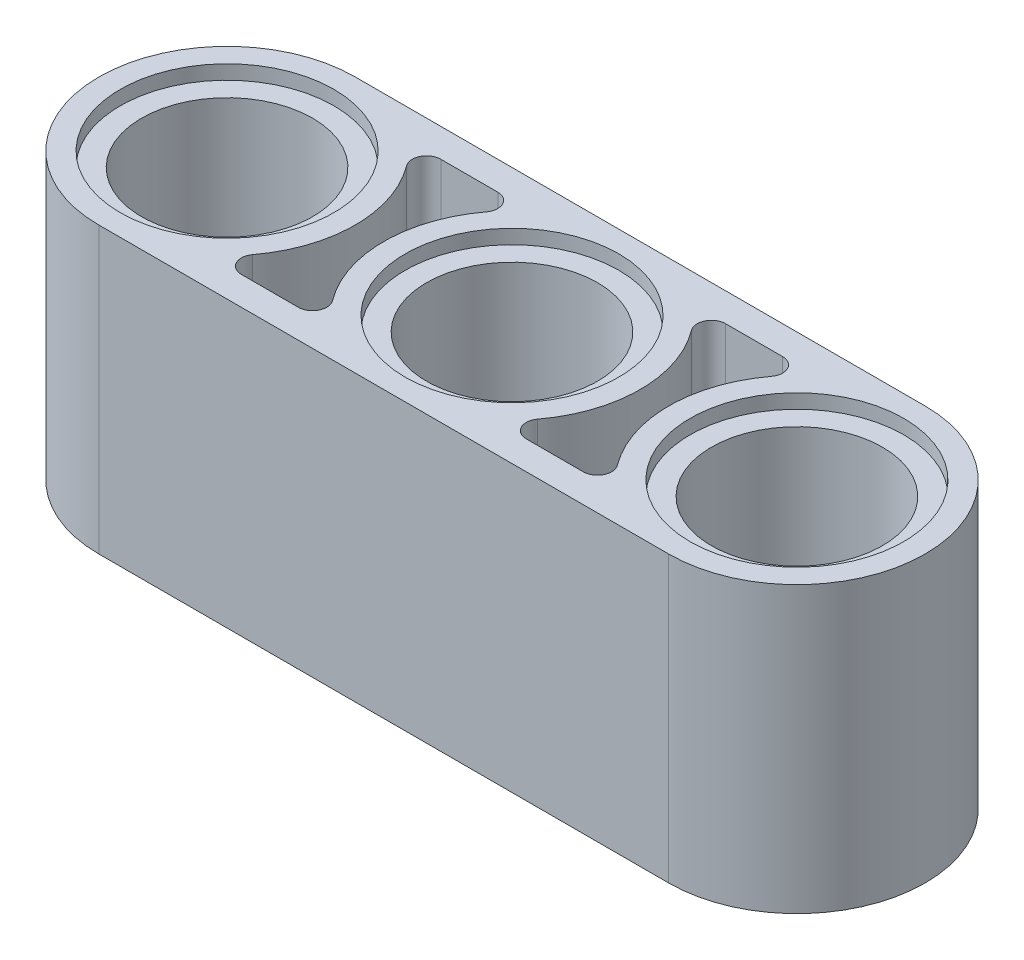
ISO-10303-21;
HEADER;
FILE_DESCRIPTION(('STEP AP214'),'2;1');
FILE_NAME('part.step','',(''),(''),'','','');
FILE_SCHEMA(('AUTOMOTIVE_DESIGN { 1 0 10303 214 1 1 1 1 }'));
ENDSEC;
DATA;
#1=APPLICATION_CONTEXT('core data for automotive mechanical design processes');
#2=APPLICATION_PROTOCOL_DEFINITION('international standard','automotive_design',2000,#1);
#3=PRODUCT_CONTEXT('',#1,'mechanical');
#4=PRODUCT('Part','Part','',(#3));
#5=PRODUCT_RELATED_PRODUCT_CATEGORY('part','',(#4));
#6=PRODUCT_DEFINITION_FORMATION('','',#4);
#7=PRODUCT_DEFINITION_CONTEXT('part definition',#1,'design');
#8=PRODUCT_DEFINITION('design','',#6,#7);
#9=PRODUCT_DEFINITION_SHAPE('','',#8);
#10=(LENGTH_UNIT() NAMED_UNIT(*) SI_UNIT(.MILLI.,.METRE.));
#11=(NAMED_UNIT(*) PLANE_ANGLE_UNIT() SI_UNIT($,.RADIAN.));
#12=(NAMED_UNIT(*) SI_UNIT($,.STERADIAN.) SOLID_ANGLE_UNIT());
#13=UNCERTAINTY_MEASURE_WITH_UNIT(LENGTH_MEASURE(1.E-05),#10,'distance_accuracy_value','');
#14=(GEOMETRIC_REPRESENTATION_CONTEXT(3) GLOBAL_UNCERTAINTY_ASSIGNED_CONTEXT((#13)) GLOBAL_UNIT_ASSIGNED_CONTEXT((#10,
#11,#12)) REPRESENTATION_CONTEXT('',''));
#15=CARTESIAN_POINT('',(0.,0.,0.));
#16=DIRECTION('',(0.,0.,1.));
#17=DIRECTION('',(1.,0.,0.));
#18=AXIS2_PLACEMENT_3D('',#15,#16,#17);
#19=CARTESIAN_POINT('',(3.2,4.8,-2.8));
#20=DIRECTION('',(0.,0.,-1.));
#21=DIRECTION('',(-1.,0.,0.));
#22=AXIS2_PLACEMENT_3D('',#19,#20,#21);
#23=PLANE('',#22);
#24=DIRECTION('',(0.,1.,0.));
#25=VECTOR('',#24,1.);
#26=CARTESIAN_POINT('',(3.2,4.8,-2.8));
#27=LINE('',#26,#25);
#28=CARTESIAN_POINT('',(3.2,8.,-2.8));
#29=VERTEX_POINT('',#28);
#30=CARTESIAN_POINT('',(3.2,4.8,-2.8));
#31=VERTEX_POINT('',#30);
#32=EDGE_CURVE('E268',#29,#31,#27,.F.);
#33=ORIENTED_EDGE('',*,*,#32,.T.);
#34=DIRECTION('',(-1.,0.,0.));
#35=VECTOR('',#34,1.);
#36=CARTESIAN_POINT('',(3.2,4.8,-2.8));
#37=LINE('',#36,#35);
#38=CARTESIAN_POINT('',(4.8,4.8,-2.8));
#39=VERTEX_POINT('',#38);
#40=EDGE_CURVE('E285',#39,#31,#37,.T.);
#41=ORIENTED_EDGE('',*,*,#40,.F.);
#42=DIRECTION('',(0.,1.,0.));
#43=VECTOR('',#42,1.);
#44=CARTESIAN_POINT('',(4.8,4.8,-2.8));
#45=LINE('',#44,#43);
#46=CARTESIAN_POINT('',(4.8,8.,-2.8));
#47=VERTEX_POINT('',#46);
#48=EDGE_CURVE('E278',#39,#47,#45,.T.);
#49=ORIENTED_EDGE('',*,*,#48,.T.);
#50=DIRECTION('',(-1.,0.,0.));
#51=VECTOR('',#50,1.);
#52=CARTESIAN_POINT('',(3.2,8.,-2.8));
#53=LINE('',#52,#51);
#54=EDGE_CURVE('E259',#29,#47,#53,.F.);
#55=ORIENTED_EDGE('',*,*,#54,.F.);
#56=EDGE_LOOP('',(#33,#41,#49,#55));
#57=FACE_BOUND('',#56,.T.);
#58=ADVANCED_FACE('F16',(#57),#23,.F.);
#59=CARTESIAN_POINT('',(4.8,4.8,2.8));
#60=DIRECTION('',(0.,0.,1.));
#61=DIRECTION('',(1.,0.,0.));
#62=AXIS2_PLACEMENT_3D('',#59,#60,#61);
#63=PLANE('',#62);
#64=DIRECTION('',(0.,1.,0.));
#65=VECTOR('',#64,1.);
#66=CARTESIAN_POINT('',(4.8,4.8,2.8));
#67=LINE('',#66,#65);
#68=CARTESIAN_POINT('',(4.8,8.,2.8));
#69=VERTEX_POINT('',#68);
#70=CARTESIAN_POINT('',(4.8,4.8,2.8));
#71=VERTEX_POINT('',#70);
#72=EDGE_CURVE('E496',#69,#71,#67,.F.);
#73=ORIENTED_EDGE('',*,*,#72,.T.);
#74=DIRECTION('',(1.,0.,0.));
#75=VECTOR('',#74,1.);
#76=CARTESIAN_POINT('',(3.2,4.8,2.8));
#77=LINE('',#76,#75);
#78=CARTESIAN_POINT('',(3.2,4.8,2.8));
#79=VERTEX_POINT('',#78);
#80=EDGE_CURVE('E271',#71,#79,#77,.F.);
#81=ORIENTED_EDGE('',*,*,#80,.T.);
#82=DIRECTION('',(0.,1.,0.));
#83=VECTOR('',#82,1.);
#84=CARTESIAN_POINT('',(3.2,4.8,2.8));
#85=LINE('',#84,#83);
#86=CARTESIAN_POINT('',(3.2,8.,2.8));
#87=VERTEX_POINT('',#86);
#88=EDGE_CURVE('E264',#79,#87,#85,.T.);
#89=ORIENTED_EDGE('',*,*,#88,.T.);
#90=DIRECTION('',(1.,0.,0.));
#91=VECTOR('',#90,1.);
#92=CARTESIAN_POINT('',(4.8,8.,2.8));
#93=LINE('',#92,#91);
#94=EDGE_CURVE('E246',#69,#87,#93,.F.);
#95=ORIENTED_EDGE('',*,*,#94,.F.);
#96=EDGE_LOOP('',(#73,#81,#89,#95));
#97=FACE_BOUND('',#96,.T.);
#98=ADVANCED_FACE('F270',(#97),#63,.F.);
#99=CARTESIAN_POINT('',(11.2,4.8,-2.8));
#100=DIRECTION('',(0.,0.,-1.));
#101=DIRECTION('',(-1.,0.,0.));
#102=AXIS2_PLACEMENT_3D('',#99,#100,#101);
#103=PLANE('',#102);
#104=DIRECTION('',(0.,1.,0.));
#105=VECTOR('',#104,1.);
#106=CARTESIAN_POINT('',(11.2,4.8,-2.8));
#107=LINE('',#106,#105);
#108=CARTESIAN_POINT('',(11.2,8.,-2.8));
#109=VERTEX_POINT('',#108);
#110=CARTESIAN_POINT('',(11.2,4.8,-2.8));
#111=VERTEX_POINT('',#110);
#112=EDGE_CURVE('E488',#109,#111,#107,.F.);
#113=ORIENTED_EDGE('',*,*,#112,.T.);
#114=DIRECTION('',(-1.,0.,0.));
#115=VECTOR('',#114,1.);
#116=CARTESIAN_POINT('',(11.2,4.8,-2.8));
#117=LINE('',#116,#115);
#118=CARTESIAN_POINT('',(12.8,4.8,-2.8));
#119=VERTEX_POINT('',#118);
#120=EDGE_CURVE('E258',#119,#111,#117,.T.);
#121=ORIENTED_EDGE('',*,*,#120,.F.);
#122=DIRECTION('',(0.,1.,0.));
#123=VECTOR('',#122,1.);
#124=CARTESIAN_POINT('',(12.8,4.8,-2.8));
#125=LINE('',#124,#123);
#126=CARTESIAN_POINT('',(12.8,8.,-2.8));
#127=VERTEX_POINT('',#126);
#128=EDGE_CURVE('E484',#119,#127,#125,.T.);
#129=ORIENTED_EDGE('',*,*,#128,.T.);
#130=DIRECTION('',(-1.,0.,0.));
#131=VECTOR('',#130,1.);
#132=CARTESIAN_POINT('',(11.2,8.,-2.8));
#133=LINE('',#132,#131);
#134=EDGE_CURVE('E556',#109,#127,#133,.F.);
#135=ORIENTED_EDGE('',*,*,#134,.F.);
#136=EDGE_LOOP('',(#113,#121,#129,#135));
#137=FACE_BOUND('',#136,.T.);
#138=ADVANCED_FACE('F1115',(#137),#103,.F.);
#139=CARTESIAN_POINT('',(12.8,4.8,2.8));
#140=DIRECTION('',(0.,0.,1.));
#141=DIRECTION('',(1.,0.,0.));
#142=AXIS2_PLACEMENT_3D('',#139,#140,#141);
#143=PLANE('',#142);
#144=DIRECTION('',(0.,1.,0.));
#145=VECTOR('',#144,1.);
#146=CARTESIAN_POINT('',(12.8,4.8,2.8));
#147=LINE('',#146,#145);
#148=CARTESIAN_POINT('',(12.8,8.,2.8));
#149=VERTEX_POINT('',#148);
#150=CARTESIAN_POINT('',(12.8,4.8,2.8));
#151=VERTEX_POINT('',#150);
#152=EDGE_CURVE('E471',#149,#151,#147,.F.);
#153=ORIENTED_EDGE('',*,*,#152,.T.);
#154=DIRECTION('',(1.,0.,0.));
#155=VECTOR('',#154,1.);
#156=CARTESIAN_POINT('',(11.2,4.8,2.8));
#157=LINE('',#156,#155);
#158=CARTESIAN_POINT('',(11.2,4.8,2.8));
#159=VERTEX_POINT('',#158);
#160=EDGE_CURVE('E475',#151,#159,#157,.F.);
#161=ORIENTED_EDGE('',*,*,#160,.T.);
#162=DIRECTION('',(0.,1.,0.));
#163=VECTOR('',#162,1.);
#164=CARTESIAN_POINT('',(11.2,4.8,2.8));
#165=LINE('',#164,#163);
#166=CARTESIAN_POINT('',(11.2,8.,2.8));
#167=VERTEX_POINT('',#166);
#168=EDGE_CURVE('E491',#159,#167,#165,.T.);
#169=ORIENTED_EDGE('',*,*,#168,.T.);
#170=DIRECTION('',(1.,0.,0.));
#171=VECTOR('',#170,1.);
#172=CARTESIAN_POINT('',(12.8,8.,2.8));
#173=LINE('',#172,#171);
#174=EDGE_CURVE('E552',#149,#167,#173,.F.);
#175=ORIENTED_EDGE('',*,*,#174,.F.);
#176=EDGE_LOOP('',(#153,#161,#169,#175));
#177=FACE_BOUND('',#176,.T.);
#178=ADVANCED_FACE('F1106',(#177),#143,.F.);
#179=CARTESIAN_POINT('',(12.8,3.2,2.8));
#180=DIRECTION('',(0.,0.,-1.));
#181=DIRECTION('',(-1.,0.,0.));
#182=AXIS2_PLACEMENT_3D('',#179,#180,#181);
#183=PLANE('',#182);
#184=DIRECTION('',(-1.,0.,0.));
#185=VECTOR('',#184,1.);
#186=CARTESIAN_POINT('',(12.8,3.2,2.8));
#187=LINE('',#186,#185);
#188=CARTESIAN_POINT('',(11.2,3.2,2.8));
#189=VERTEX_POINT('',#188);
#190=CARTESIAN_POINT('',(12.8,3.2,2.8));
#191=VERTEX_POINT('',#190);
#192=EDGE_CURVE('E542',#189,#191,#187,.F.);
#193=ORIENTED_EDGE('',*,*,#192,.T.);
#194=DIRECTION('',(0.,-1.,0.));
#195=VECTOR('',#194,1.);
#196=CARTESIAN_POINT('',(12.8,3.2,2.8));
#197=LINE('',#196,#195);
#198=CARTESIAN_POINT('',(12.8,0.,2.8));
#199=VERTEX_POINT('',#198);
#200=EDGE_CURVE('E448',#191,#199,#197,.T.);
#201=ORIENTED_EDGE('',*,*,#200,.T.);
#202=DIRECTION('',(-1.,0.,0.));
#203=VECTOR('',#202,1.);
#204=CARTESIAN_POINT('',(12.8,0.,2.8));
#205=LINE('',#204,#203);
#206=CARTESIAN_POINT('',(11.2,0.,2.8));
#207=VERTEX_POINT('',#206);
#208=EDGE_CURVE('E550',#199,#207,#205,.T.);
#209=ORIENTED_EDGE('',*,*,#208,.T.);
#210=DIRECTION('',(0.,-1.,0.));
#211=VECTOR('',#210,1.);
#212=CARTESIAN_POINT('',(11.2,3.2,2.8));
#213=LINE('',#212,#211);
#214=EDGE_CURVE('E452',#207,#189,#213,.F.);
#215=ORIENTED_EDGE('',*,*,#214,.T.);
#216=EDGE_LOOP('',(#193,#201,#209,#215));
#217=FACE_BOUND('',#216,.T.);
#218=ADVANCED_FACE('F1097',(#217),#183,.T.);
#219=CARTESIAN_POINT('',(11.2,3.2,-2.8));
#220=DIRECTION('',(0.,0.,1.));
#221=DIRECTION('',(1.,0.,0.));
#222=AXIS2_PLACEMENT_3D('',#219,#220,#221);
#223=PLANE('',#222);
#224=DIRECTION('',(1.,0.,0.));
#225=VECTOR('',#224,1.);
#226=CARTESIAN_POINT('',(11.2,3.2,-2.8));
#227=LINE('',#226,#225);
#228=CARTESIAN_POINT('',(12.8,3.2,-2.8));
#229=VERTEX_POINT('',#228);
#230=CARTESIAN_POINT('',(11.2,3.2,-2.8));
#231=VERTEX_POINT('',#230);
#232=EDGE_CURVE('E442',#229,#231,#227,.F.);
#233=ORIENTED_EDGE('',*,*,#232,.T.);
#234=DIRECTION('',(0.,-1.,0.));
#235=VECTOR('',#234,1.);
#236=CARTESIAN_POINT('',(11.2,3.2,-2.8));
#237=LINE('',#236,#235);
#238=CARTESIAN_POINT('',(11.2,0.,-2.8));
#239=VERTEX_POINT('',#238);
#240=EDGE_CURVE('E455',#231,#239,#237,.T.);
#241=ORIENTED_EDGE('',*,*,#240,.T.);
#242=DIRECTION('',(1.,0.,0.));
#243=VECTOR('',#242,1.);
#244=CARTESIAN_POINT('',(11.2,0.,-2.8));
#245=LINE('',#244,#243);
#246=CARTESIAN_POINT('',(12.8,0.,-2.8));
#247=VERTEX_POINT('',#246);
#248=EDGE_CURVE('E538',#239,#247,#245,.T.);
#249=ORIENTED_EDGE('',*,*,#248,.T.);
#250=DIRECTION('',(0.,-1.,0.));
#251=VECTOR('',#250,1.);
#252=CARTESIAN_POINT('',(12.8,3.2,-2.8));
#253=LINE('',#252,#251);
#254=EDGE_CURVE('E435',#247,#229,#253,.F.);
#255=ORIENTED_EDGE('',*,*,#254,.T.);
#256=EDGE_LOOP('',(#233,#241,#249,#255));
#257=FACE_BOUND('',#256,.T.);
#258=ADVANCED_FACE('F1087',(#257),#223,.T.);
#259=CARTESIAN_POINT('',(0.,8.,0.));
#260=DIRECTION('',(0.,-1.,0.));
#261=DIRECTION('',(0.,0.,-1.));
#262=AXIS2_PLACEMENT_3D('',#259,#260,#261);
#263=CYLINDRICAL_SURFACE('',#262,2.4);
#264=CARTESIAN_POINT('',(0.,0.4,0.));
#265=DIRECTION('',(0.,-1.,0.));
#266=DIRECTION('',(0.,0.,-1.));
#267=AXIS2_PLACEMENT_3D('',#264,#265,#266);
#268=CIRCLE('',#267,2.4);
#269=CARTESIAN_POINT('',(0.,0.4,-2.4));
#270=VERTEX_POINT('',#269);
#271=EDGE_CURVE('E426',#270,#270,#268,.F.);
#272=ORIENTED_EDGE('',*,*,#271,.F.);
#273=EDGE_LOOP('',(#272));
#274=FACE_BOUND('',#273,.T.);
#275=CARTESIAN_POINT('',(0.,7.6,0.));
#276=DIRECTION('',(0.,-1.,0.));
#277=DIRECTION('',(0.,0.,-1.));
#278=AXIS2_PLACEMENT_3D('',#275,#276,#277);
#279=CIRCLE('',#278,2.4);
#280=CARTESIAN_POINT('',(0.,7.6,-2.4));
#281=VERTEX_POINT('',#280);
#282=EDGE_CURVE('E462',#281,#281,#279,.T.);
#283=ORIENTED_EDGE('',*,*,#282,.F.);
#284=EDGE_LOOP('',(#283));
#285=FACE_BOUND('',#284,.T.);
#286=ADVANCED_FACE('F1077',(#274,#285),#263,.F.);
#287=CARTESIAN_POINT('',(8.,8.,0.));
#288=DIRECTION('',(0.,-1.,0.));
#289=DIRECTION('',(0.,0.,-1.));
#290=AXIS2_PLACEMENT_3D('',#287,#288,#289);
#291=CYLINDRICAL_SURFACE('',#290,2.4);
#292=CARTESIAN_POINT('',(8.,0.4,0.));
#293=DIRECTION('',(0.,-1.,0.));
#294=DIRECTION('',(0.,0.,-1.));
#295=AXIS2_PLACEMENT_3D('',#292,#293,#294);
#296=CIRCLE('',#295,2.4);
#297=CARTESIAN_POINT('',(8.,0.4,-2.4));
#298=VERTEX_POINT('',#297);
#299=EDGE_CURVE('E423',#298,#298,#296,.F.);
#300=ORIENTED_EDGE('',*,*,#299,.F.);
#301=EDGE_LOOP('',(#300));
#302=FACE_BOUND('',#301,.T.);
#303=CARTESIAN_POINT('',(8.,7.6,0.));
#304=DIRECTION('',(0.,-1.,0.));
#305=DIRECTION('',(0.,0.,-1.));
#306=AXIS2_PLACEMENT_3D('',#303,#304,#305);
#307=CIRCLE('',#306,2.4);
#308=CARTESIAN_POINT('',(8.,7.6,-2.4));
#309=VERTEX_POINT('',#308);
#310=EDGE_CURVE('E459',#309,#309,#307,.T.);
#311=ORIENTED_EDGE('',*,*,#310,.F.);
#312=EDGE_LOOP('',(#311));
#313=FACE_BOUND('',#312,.T.);
#314=ADVANCED_FACE('F1068',(#302,#313),#291,.F.);
#315=CARTESIAN_POINT('',(16.,8.,0.));
#316=DIRECTION('',(0.,-1.,0.));
#317=DIRECTION('',(0.,0.,-1.));
#318=AXIS2_PLACEMENT_3D('',#315,#316,#317);
#319=CYLINDRICAL_SURFACE('',#318,2.4);
#320=CARTESIAN_POINT('',(16.,0.4,0.));
#321=DIRECTION('',(0.,-1.,0.));
#322=DIRECTION('',(0.,0.,-1.));
#323=AXIS2_PLACEMENT_3D('',#320,#321,#322);
#324=CIRCLE('',#323,2.4);
#325=CARTESIAN_POINT('',(16.,0.4,-2.4));
#326=VERTEX_POINT('',#325);
#327=EDGE_CURVE('E420',#326,#326,#324,.F.);
#328=ORIENTED_EDGE('',*,*,#327,.F.);
#329=EDGE_LOOP('',(#328));
#330=FACE_BOUND('',#329,.T.);
#331=CARTESIAN_POINT('',(16.,7.6,0.));
#332=DIRECTION('',(0.,-1.,0.));
#333=DIRECTION('',(0.,0.,-1.));
#334=AXIS2_PLACEMENT_3D('',#331,#332,#333);
#335=CIRCLE('',#334,2.4);
#336=CARTESIAN_POINT('',(16.,7.6,-2.4));
#337=VERTEX_POINT('',#336);
#338=EDGE_CURVE('E456',#337,#337,#335,.T.);
#339=ORIENTED_EDGE('',*,*,#338,.F.);
#340=EDGE_LOOP('',(#339));
#341=FACE_BOUND('',#340,.T.);
#342=ADVANCED_FACE('F1059',(#330,#341),#319,.F.);
#343=CARTESIAN_POINT('',(4.8,3.2,2.8));
#344=DIRECTION('',(0.,0.,-1.));
#345=DIRECTION('',(-1.,0.,0.));
#346=AXIS2_PLACEMENT_3D('',#343,#344,#345);
#347=PLANE('',#346);
#348=DIRECTION('',(-1.,0.,0.));
#349=VECTOR('',#348,1.);
#350=CARTESIAN_POINT('',(4.8,3.2,2.8));
#351=LINE('',#350,#349);
#352=CARTESIAN_POINT('',(3.2,3.2,2.8));
#353=VERTEX_POINT('',#352);
#354=CARTESIAN_POINT('',(4.8,3.2,2.8));
#355=VERTEX_POINT('',#354);
#356=EDGE_CURVE('E274',#353,#355,#351,.F.);
#357=ORIENTED_EDGE('',*,*,#356,.T.);
#358=DIRECTION('',(0.,-1.,0.));
#359=VECTOR('',#358,1.);
#360=CARTESIAN_POINT('',(4.8,3.2,2.8));
#361=LINE('',#360,#359);
#362=CARTESIAN_POINT('',(4.8,0.,2.8));
#363=VERTEX_POINT('',#362);
#364=EDGE_CURVE('E412',#355,#363,#361,.T.);
#365=ORIENTED_EDGE('',*,*,#364,.T.);
#366=DIRECTION('',(-1.,0.,0.));
#367=VECTOR('',#366,1.);
#368=CARTESIAN_POINT('',(4.8,0.,2.8));
#369=LINE('',#368,#367);
#370=CARTESIAN_POINT('',(3.2,0.,2.8));
#371=VERTEX_POINT('',#370);
#372=EDGE_CURVE('E536',#363,#371,#369,.T.);
#373=ORIENTED_EDGE('',*,*,#372,.T.);
#374=DIRECTION('',(0.,-1.,0.));
#375=VECTOR('',#374,1.);
#376=CARTESIAN_POINT('',(3.2,3.2,2.8));
#377=LINE('',#376,#375);
#378=EDGE_CURVE('E416',#371,#353,#377,.F.);
#379=ORIENTED_EDGE('',*,*,#378,.T.);
#380=EDGE_LOOP('',(#357,#365,#373,#379));
#381=FACE_BOUND('',#380,.T.);
#382=ADVANCED_FACE('F1050',(#381),#347,.T.);
#383=CARTESIAN_POINT('',(3.2,3.2,-2.8));
#384=DIRECTION('',(0.,0.,1.));
#385=DIRECTION('',(1.,0.,0.));
#386=AXIS2_PLACEMENT_3D('',#383,#384,#385);
#387=PLANE('',#386);
#388=DIRECTION('',(1.,0.,0.));
#389=VECTOR('',#388,1.);
#390=CARTESIAN_POINT('',(3.2,3.2,-2.8));
#391=LINE('',#390,#389);
#392=CARTESIAN_POINT('',(4.8,3.2,-2.8));
#393=VERTEX_POINT('',#392);
#394=CARTESIAN_POINT('',(3.2,3.2,-2.8));
#395=VERTEX_POINT('',#394);
#396=EDGE_CURVE('E406',#393,#395,#391,.F.);
#397=ORIENTED_EDGE('',*,*,#396,.T.);
#398=DIRECTION('',(0.,-1.,0.));
#399=VECTOR('',#398,1.);
#400=CARTESIAN_POINT('',(3.2,3.2,-2.8));
#401=LINE('',#400,#399);
#402=CARTESIAN_POINT('',(3.2,0.,-2.8));
#403=VERTEX_POINT('',#402);
#404=EDGE_CURVE('E419',#395,#403,#401,.T.);
#405=ORIENTED_EDGE('',*,*,#404,.T.);
#406=DIRECTION('',(1.,0.,0.));
#407=VECTOR('',#406,1.);
#408=CARTESIAN_POINT('',(3.2,0.,-2.8));
#409=LINE('',#408,#407);
#410=CARTESIAN_POINT('',(4.8,0.,-2.8));
#411=VERTEX_POINT('',#410);
#412=EDGE_CURVE('E272',#403,#411,#409,.T.);
#413=ORIENTED_EDGE('',*,*,#412,.T.);
#414=DIRECTION('',(0.,-1.,0.));
#415=VECTOR('',#414,1.);
#416=CARTESIAN_POINT('',(4.8,3.2,-2.8));
#417=LINE('',#416,#415);
#418=EDGE_CURVE('E399',#411,#393,#417,.F.);
#419=ORIENTED_EDGE('',*,*,#418,.T.);
#420=EDGE_LOOP('',(#397,#405,#413,#419));
#421=FACE_BOUND('',#420,.T.);
#422=ADVANCED_FACE('F1042',(#421),#387,.T.);
#423=CARTESIAN_POINT('',(3.2,4.8,2.4));
#424=DIRECTION('',(0.,1.,0.));
#425=DIRECTION('',(0.,0.,1.));
#426=AXIS2_PLACEMENT_3D('',#423,#424,#425);
#427=CYLINDRICAL_SURFACE('',#426,0.4);
#428=ORIENTED_EDGE('',*,*,#88,.F.);
#429=CARTESIAN_POINT('',(3.2,4.8,2.4));
#430=DIRECTION('',(0.,1.,0.));
#431=DIRECTION('',(0.,0.,1.));
#432=AXIS2_PLACEMENT_3D('',#429,#430,#431);
#433=CIRCLE('',#432,0.4);
#434=CARTESIAN_POINT('',(2.88,4.8,2.16));
#435=VERTEX_POINT('',#434);
#436=EDGE_CURVE('E497',#79,#435,#433,.F.);
#437=ORIENTED_EDGE('',*,*,#436,.T.);
#438=DIRECTION('',(0.,1.,0.));
#439=VECTOR('',#438,1.);
#440=CARTESIAN_POINT('',(2.88,4.8,2.16));
#441=LINE('',#440,#439);
#442=CARTESIAN_POINT('',(2.88,8.,2.16));
#443=VERTEX_POINT('',#442);
#444=EDGE_CURVE('E266',#443,#435,#441,.F.);
#445=ORIENTED_EDGE('',*,*,#444,.F.);
#446=CARTESIAN_POINT('',(3.2,8.,2.4));
#447=DIRECTION('',(0.,1.,0.));
#448=DIRECTION('',(0.,0.,1.));
#449=AXIS2_PLACEMENT_3D('',#446,#447,#448);
#450=CIRCLE('',#449,0.4);
#451=EDGE_CURVE('E19',#87,#443,#450,.F.);
#452=ORIENTED_EDGE('',*,*,#451,.F.);
#453=EDGE_LOOP('',(#428,#437,#445,#452));
#454=FACE_BOUND('',#453,.T.);
#455=ADVANCED_FACE('F262',(#454),#427,.F.);
#456=CARTESIAN_POINT('',(3.2,4.8,-2.4));
#457=DIRECTION('',(0.,1.,0.));
#458=DIRECTION('',(0.,0.,1.));
#459=AXIS2_PLACEMENT_3D('',#456,#457,#458);
#460=CYLINDRICAL_SURFACE('',#459,0.4);
#461=DIRECTION('',(0.,1.,0.));
#462=VECTOR('',#461,1.);
#463=CARTESIAN_POINT('',(2.88,4.8,-2.16));
#464=LINE('',#463,#462);
#465=CARTESIAN_POINT('',(2.88,4.8,-2.16));
#466=VERTEX_POINT('',#465);
#467=CARTESIAN_POINT('',(2.88,8.,-2.16));
#468=VERTEX_POINT('',#467);
#469=EDGE_CURVE('E392',#466,#468,#464,.T.);
#470=ORIENTED_EDGE('',*,*,#469,.F.);
#471=CARTESIAN_POINT('',(3.2,4.8,-2.4));
#472=DIRECTION('',(0.,1.,0.));
#473=DIRECTION('',(0.,0.,1.));
#474=AXIS2_PLACEMENT_3D('',#471,#472,#473);
#475=CIRCLE('',#474,0.4);
#476=EDGE_CURVE('E502',#466,#31,#475,.F.);
#477=ORIENTED_EDGE('',*,*,#476,.T.);
#478=ORIENTED_EDGE('',*,*,#32,.F.);
#479=CARTESIAN_POINT('',(3.2,8.,-2.4));
#480=DIRECTION('',(0.,1.,0.));
#481=DIRECTION('',(0.,0.,1.));
#482=AXIS2_PLACEMENT_3D('',#479,#480,#481);
#483=CIRCLE('',#482,0.4);
#484=EDGE_CURVE('E282',#468,#29,#483,.F.);
#485=ORIENTED_EDGE('',*,*,#484,.F.);
#486=EDGE_LOOP('',(#470,#477,#478,#485));
#487=FACE_BOUND('',#486,.T.);
#488=ADVANCED_FACE('F511',(#487),#460,.F.);
#489=CARTESIAN_POINT('',(4.8,4.8,-2.4));
#490=DIRECTION('',(0.,1.,0.));
#491=DIRECTION('',(0.,0.,1.));
#492=AXIS2_PLACEMENT_3D('',#489,#490,#491);
#493=CYLINDRICAL_SURFACE('',#492,0.4);
#494=ORIENTED_EDGE('',*,*,#48,.F.);
#495=CARTESIAN_POINT('',(4.8,4.8,-2.4));
#496=DIRECTION('',(0.,1.,0.));
#497=DIRECTION('',(0.,0.,1.));
#498=AXIS2_PLACEMENT_3D('',#495,#496,#497);
#499=CIRCLE('',#498,0.4);
#500=CARTESIAN_POINT('',(5.12,4.8,-2.16));
#501=VERTEX_POINT('',#500);
#502=EDGE_CURVE('E499',#39,#501,#499,.F.);
#503=ORIENTED_EDGE('',*,*,#502,.T.);
#504=DIRECTION('',(0.,1.,0.));
#505=VECTOR('',#504,1.);
#506=CARTESIAN_POINT('',(5.12,4.8,-2.16));
#507=LINE('',#506,#505);
#508=CARTESIAN_POINT('',(5.12,8.,-2.16));
#509=VERTEX_POINT('',#508);
#510=EDGE_CURVE('E388',#509,#501,#507,.F.);
#511=ORIENTED_EDGE('',*,*,#510,.F.);
#512=CARTESIAN_POINT('',(4.8,8.,-2.4));
#513=DIRECTION('',(0.,1.,0.));
#514=DIRECTION('',(0.,0.,1.));
#515=AXIS2_PLACEMENT_3D('',#512,#513,#514);
#516=CIRCLE('',#515,0.4);
#517=EDGE_CURVE('E281',#47,#509,#516,.F.);
#518=ORIENTED_EDGE('',*,*,#517,.F.);
#519=EDGE_LOOP('',(#494,#503,#511,#518));
#520=FACE_BOUND('',#519,.T.);
#521=ADVANCED_FACE('F576',(#520),#493,.F.);
#522=CARTESIAN_POINT('',(3.2,4.8,2.4));
#523=DIRECTION('',(0.,-1.,0.));
#524=DIRECTION('',(0.,0.,-1.));
#525=AXIS2_PLACEMENT_3D('',#522,#523,#524);
#526=PLANE('',#525);
#527=ORIENTED_EDGE('',*,*,#80,.F.);
#528=CARTESIAN_POINT('',(4.8,4.8,2.4));
#529=DIRECTION('',(0.,1.,0.));
#530=DIRECTION('',(0.,0.,1.));
#531=AXIS2_PLACEMENT_3D('',#528,#529,#530);
#532=CIRCLE('',#531,0.4);
#533=CARTESIAN_POINT('',(5.12,4.8,2.16));
#534=VERTEX_POINT('',#533);
#535=EDGE_CURVE('E493',#71,#534,#532,.T.);
#536=ORIENTED_EDGE('',*,*,#535,.T.);
#537=CARTESIAN_POINT('',(8.,4.8,0.));
#538=DIRECTION('',(0.,1.,0.));
#539=DIRECTION('',(0.,0.,1.));
#540=AXIS2_PLACEMENT_3D('',#537,#538,#539);
#541=CIRCLE('',#540,3.6);
#542=EDGE_CURVE('E385',#501,#534,#541,.T.);
#543=ORIENTED_EDGE('',*,*,#542,.F.);
#544=ORIENTED_EDGE('',*,*,#502,.F.);
#545=ORIENTED_EDGE('',*,*,#40,.T.);
#546=ORIENTED_EDGE('',*,*,#476,.F.);
#547=CARTESIAN_POINT('',(0.,4.8,0.));
#548=DIRECTION('',(0.,1.,0.));
#549=DIRECTION('',(0.,0.,1.));
#550=AXIS2_PLACEMENT_3D('',#547,#548,#549);
#551=CIRCLE('',#550,3.6);
#552=EDGE_CURVE('E389',#435,#466,#551,.T.);
#553=ORIENTED_EDGE('',*,*,#552,.F.);
#554=ORIENTED_EDGE('',*,*,#436,.F.);
#555=EDGE_LOOP('',(#527,#536,#543,#544,#545,#546,#553,#554));
#556=FACE_BOUND('',#555,.T.);
#557=ADVANCED_FACE('F571',(#556),#526,.F.);
#558=CARTESIAN_POINT('',(4.8,4.8,2.4));
#559=DIRECTION('',(0.,1.,0.));
#560=DIRECTION('',(0.,0.,1.));
#561=AXIS2_PLACEMENT_3D('',#558,#559,#560);
#562=CYLINDRICAL_SURFACE('',#561,0.4);
#563=DIRECTION('',(0.,1.,0.));
#564=VECTOR('',#563,1.);
#565=CARTESIAN_POINT('',(5.12,4.8,2.16));
#566=LINE('',#565,#564);
#567=CARTESIAN_POINT('',(5.12,8.,2.16));
#568=VERTEX_POINT('',#567);
#569=EDGE_CURVE('E387',#534,#568,#566,.T.);
#570=ORIENTED_EDGE('',*,*,#569,.F.);
#571=ORIENTED_EDGE('',*,*,#535,.F.);
#572=ORIENTED_EDGE('',*,*,#72,.F.);
#573=CARTESIAN_POINT('',(4.8,8.,2.4));
#574=DIRECTION('',(0.,1.,0.));
#575=DIRECTION('',(0.,0.,1.));
#576=AXIS2_PLACEMENT_3D('',#573,#574,#575);
#577=CIRCLE('',#576,0.4);
#578=EDGE_CURVE('E253',#568,#69,#577,.F.);
#579=ORIENTED_EDGE('',*,*,#578,.F.);
#580=EDGE_LOOP('',(#570,#571,#572,#579));
#581=FACE_BOUND('',#580,.T.);
#582=ADVANCED_FACE('F567',(#581),#562,.F.);
#583=CARTESIAN_POINT('',(11.2,4.8,2.4));
#584=DIRECTION('',(0.,1.,0.));
#585=DIRECTION('',(0.,0.,1.));
#586=AXIS2_PLACEMENT_3D('',#583,#584,#585);
#587=CYLINDRICAL_SURFACE('',#586,0.4);
#588=ORIENTED_EDGE('',*,*,#168,.F.);
#589=CARTESIAN_POINT('',(11.2,4.8,2.4));
#590=DIRECTION('',(0.,1.,0.));
#591=DIRECTION('',(0.,0.,1.));
#592=AXIS2_PLACEMENT_3D('',#589,#590,#591);
#593=CIRCLE('',#592,0.4);
#594=CARTESIAN_POINT('',(10.88,4.8,2.16));
#595=VERTEX_POINT('',#594);
#596=EDGE_CURVE('E472',#159,#595,#593,.F.);
#597=ORIENTED_EDGE('',*,*,#596,.T.);
#598=DIRECTION('',(0.,1.,0.));
#599=VECTOR('',#598,1.);
#600=CARTESIAN_POINT('',(10.88,4.8,2.16));
#601=LINE('',#600,#599);
#602=CARTESIAN_POINT('',(10.88,8.,2.16));
#603=VERTEX_POINT('',#602);
#604=EDGE_CURVE('E384',#603,#595,#601,.F.);
#605=ORIENTED_EDGE('',*,*,#604,.F.);
#606=CARTESIAN_POINT('',(11.2,8.,2.4));
#607=DIRECTION('',(0.,1.,0.));
#608=DIRECTION('',(0.,0.,1.));
#609=AXIS2_PLACEMENT_3D('',#606,#607,#608);
#610=CIRCLE('',#609,0.4);
#611=EDGE_CURVE('E489',#167,#603,#610,.F.);
#612=ORIENTED_EDGE('',*,*,#611,.F.);
#613=EDGE_LOOP('',(#588,#597,#605,#612));
#614=FACE_BOUND('',#613,.T.);
#615=ADVANCED_FACE('F997',(#614),#587,.F.);
#616=CARTESIAN_POINT('',(11.2,4.8,-2.4));
#617=DIRECTION('',(0.,1.,0.));
#618=DIRECTION('',(0.,0.,1.));
#619=AXIS2_PLACEMENT_3D('',#616,#617,#618);
#620=CYLINDRICAL_SURFACE('',#619,0.4);
#621=DIRECTION('',(0.,1.,0.));
#622=VECTOR('',#621,1.);
#623=CARTESIAN_POINT('',(10.88,4.8,-2.16));
#624=LINE('',#623,#622);
#625=CARTESIAN_POINT('',(10.88,4.8,-2.16));
#626=VERTEX_POINT('',#625);
#627=CARTESIAN_POINT('',(10.88,8.,-2.16));
#628=VERTEX_POINT('',#627);
#629=EDGE_CURVE('E383',#626,#628,#624,.T.);
#630=ORIENTED_EDGE('',*,*,#629,.F.);
#631=CARTESIAN_POINT('',(11.2,4.8,-2.4));
#632=DIRECTION('',(0.,1.,0.));
#633=DIRECTION('',(0.,0.,1.));
#634=AXIS2_PLACEMENT_3D('',#631,#632,#633);
#635=CIRCLE('',#634,0.4);
#636=EDGE_CURVE('E479',#626,#111,#635,.F.);
#637=ORIENTED_EDGE('',*,*,#636,.T.);
#638=ORIENTED_EDGE('',*,*,#112,.F.);
#639=CARTESIAN_POINT('',(11.2,8.,-2.4));
#640=DIRECTION('',(0.,1.,0.));
#641=DIRECTION('',(0.,0.,1.));
#642=AXIS2_PLACEMENT_3D('',#639,#640,#641);
#643=CIRCLE('',#642,0.4);
#644=EDGE_CURVE('E485',#628,#109,#643,.F.);
#645=ORIENTED_EDGE('',*,*,#644,.F.);
#646=EDGE_LOOP('',(#630,#637,#638,#645));
#647=FACE_BOUND('',#646,.T.);
#648=ADVANCED_FACE('F988',(#647),#620,.F.);
#649=CARTESIAN_POINT('',(12.8,4.8,-2.4));
#650=DIRECTION('',(0.,1.,0.));
#651=DIRECTION('',(0.,0.,1.));
#652=AXIS2_PLACEMENT_3D('',#649,#650,#651);
#653=CYLINDRICAL_SURFACE('',#652,0.4);
#654=ORIENTED_EDGE('',*,*,#128,.F.);
#655=CARTESIAN_POINT('',(12.8,4.8,-2.4));
#656=DIRECTION('',(0.,1.,0.));
#657=DIRECTION('',(0.,0.,1.));
#658=AXIS2_PLACEMENT_3D('',#655,#656,#657);
#659=CIRCLE('',#658,0.4);
#660=CARTESIAN_POINT('',(13.12,4.8,-2.16));
#661=VERTEX_POINT('',#660);
#662=EDGE_CURVE('E476',#119,#661,#659,.F.);
#663=ORIENTED_EDGE('',*,*,#662,.T.);
#664=DIRECTION('',(0.,1.,0.));
#665=VECTOR('',#664,1.);
#666=CARTESIAN_POINT('',(13.12,4.8,-2.16));
#667=LINE('',#666,#665);
#668=CARTESIAN_POINT('',(13.12,8.,-2.16));
#669=VERTEX_POINT('',#668);
#670=EDGE_CURVE('E379',#669,#661,#667,.F.);
#671=ORIENTED_EDGE('',*,*,#670,.F.);
#672=CARTESIAN_POINT('',(12.8,8.,-2.4));
#673=DIRECTION('',(0.,1.,0.));
#674=DIRECTION('',(0.,0.,1.));
#675=AXIS2_PLACEMENT_3D('',#672,#673,#674);
#676=CIRCLE('',#675,0.4);
#677=EDGE_CURVE('E482',#127,#669,#676,.F.);
#678=ORIENTED_EDGE('',*,*,#677,.F.);
#679=EDGE_LOOP('',(#654,#663,#671,#678));
#680=FACE_BOUND('',#679,.T.);
#681=ADVANCED_FACE('F979',(#680),#653,.F.);
#682=CARTESIAN_POINT('',(11.2,4.8,2.4));
#683=DIRECTION('',(0.,-1.,0.));
#684=DIRECTION('',(0.,0.,-1.));
#685=AXIS2_PLACEMENT_3D('',#682,#683,#684);
#686=PLANE('',#685);
#687=ORIENTED_EDGE('',*,*,#160,.F.);
#688=CARTESIAN_POINT('',(12.8,4.8,2.4));
#689=DIRECTION('',(0.,1.,0.));
#690=DIRECTION('',(0.,0.,1.));
#691=AXIS2_PLACEMENT_3D('',#688,#689,#690);
#692=CIRCLE('',#691,0.4);
#693=CARTESIAN_POINT('',(13.12,4.8,2.16));
#694=VERTEX_POINT('',#693);
#695=EDGE_CURVE('E468',#151,#694,#692,.T.);
#696=ORIENTED_EDGE('',*,*,#695,.T.);
#697=CARTESIAN_POINT('',(16.,4.8,0.));
#698=DIRECTION('',(0.,1.,0.));
#699=DIRECTION('',(0.,0.,1.));
#700=AXIS2_PLACEMENT_3D('',#697,#698,#699);
#701=CIRCLE('',#700,3.6);
#702=EDGE_CURVE('E377',#661,#694,#701,.T.);
#703=ORIENTED_EDGE('',*,*,#702,.F.);
#704=ORIENTED_EDGE('',*,*,#662,.F.);
#705=ORIENTED_EDGE('',*,*,#120,.T.);
#706=ORIENTED_EDGE('',*,*,#636,.F.);
#707=CARTESIAN_POINT('',(8.,4.8,0.));
#708=DIRECTION('',(0.,1.,0.));
#709=DIRECTION('',(0.,0.,1.));
#710=AXIS2_PLACEMENT_3D('',#707,#708,#709);
#711=CIRCLE('',#710,3.6);
#712=EDGE_CURVE('E380',#595,#626,#711,.T.);
#713=ORIENTED_EDGE('',*,*,#712,.F.);
#714=ORIENTED_EDGE('',*,*,#596,.F.);
#715=EDGE_LOOP('',(#687,#696,#703,#704,#705,#706,#713,#714));
#716=FACE_BOUND('',#715,.T.);
#717=ADVANCED_FACE('F970',(#716),#686,.F.);
#718=CARTESIAN_POINT('',(12.8,4.8,2.4));
#719=DIRECTION('',(0.,1.,0.));
#720=DIRECTION('',(0.,0.,1.));
#721=AXIS2_PLACEMENT_3D('',#718,#719,#720);
#722=CYLINDRICAL_SURFACE('',#721,0.4);
#723=DIRECTION('',(0.,1.,0.));
#724=VECTOR('',#723,1.);
#725=CARTESIAN_POINT('',(13.12,4.8,2.16));
#726=LINE('',#725,#724);
#727=CARTESIAN_POINT('',(13.12,8.,2.16));
#728=VERTEX_POINT('',#727);
#729=EDGE_CURVE('E376',#694,#728,#726,.T.);
#730=ORIENTED_EDGE('',*,*,#729,.F.);
#731=ORIENTED_EDGE('',*,*,#695,.F.);
#732=ORIENTED_EDGE('',*,*,#152,.F.);
#733=CARTESIAN_POINT('',(12.8,8.,2.4));
#734=DIRECTION('',(0.,1.,0.));
#735=DIRECTION('',(0.,0.,1.));
#736=AXIS2_PLACEMENT_3D('',#733,#734,#735);
#737=CIRCLE('',#736,0.4);
#738=EDGE_CURVE('E465',#728,#149,#737,.F.);
#739=ORIENTED_EDGE('',*,*,#738,.F.);
#740=EDGE_LOOP('',(#730,#731,#732,#739));
#741=FACE_BOUND('',#740,.T.);
#742=ADVANCED_FACE('F961',(#741),#722,.F.);
#743=CARTESIAN_POINT('',(0.,7.6,0.));
#744=DIRECTION('',(0.,1.,0.));
#745=DIRECTION('',(0.,0.,1.));
#746=AXIS2_PLACEMENT_3D('',#743,#744,#745);
#747=PLANE('',#746);
#748=CARTESIAN_POINT('',(0.,7.6,0.));
#749=DIRECTION('',(0.,1.,0.));
#750=DIRECTION('',(0.,0.,1.));
#751=AXIS2_PLACEMENT_3D('',#748,#749,#750);
#752=CIRCLE('',#751,3.);
#753=CARTESIAN_POINT('',(0.,7.6,3.));
#754=VERTEX_POINT('',#753);
#755=EDGE_CURVE('E373',#754,#754,#752,.T.);
#756=ORIENTED_EDGE('',*,*,#755,.T.);
#757=EDGE_LOOP('',(#756));
#758=FACE_BOUND('',#757,.T.);
#759=ORIENTED_EDGE('',*,*,#282,.T.);
#760=EDGE_LOOP('',(#759));
#761=FACE_BOUND('',#760,.T.);
#762=ADVANCED_FACE('F952',(#758,#761),#747,.T.);
#763=CARTESIAN_POINT('',(8.,7.6,0.));
#764=DIRECTION('',(0.,1.,0.));
#765=DIRECTION('',(0.,0.,1.));
#766=AXIS2_PLACEMENT_3D('',#763,#764,#765);
#767=PLANE('',#766);
#768=CARTESIAN_POINT('',(8.,7.6,0.));
#769=DIRECTION('',(0.,1.,0.));
#770=DIRECTION('',(0.,0.,1.));
#771=AXIS2_PLACEMENT_3D('',#768,#769,#770);
#772=CIRCLE('',#771,3.);
#773=CARTESIAN_POINT('',(8.,7.6,3.));
#774=VERTEX_POINT('',#773);
#775=EDGE_CURVE('E370',#774,#774,#772,.T.);
#776=ORIENTED_EDGE('',*,*,#775,.T.);
#777=EDGE_LOOP('',(#776));
#778=FACE_BOUND('',#777,.T.);
#779=ORIENTED_EDGE('',*,*,#310,.T.);
#780=EDGE_LOOP('',(#779));
#781=FACE_BOUND('',#780,.T.);
#782=ADVANCED_FACE('F943',(#778,#781),#767,.T.);
#783=CARTESIAN_POINT('',(16.,7.6,0.));
#784=DIRECTION('',(0.,1.,0.));
#785=DIRECTION('',(0.,0.,1.));
#786=AXIS2_PLACEMENT_3D('',#783,#784,#785);
#787=PLANE('',#786);
#788=CARTESIAN_POINT('',(16.,7.6,0.));
#789=DIRECTION('',(0.,1.,0.));
#790=DIRECTION('',(0.,0.,1.));
#791=AXIS2_PLACEMENT_3D('',#788,#789,#790);
#792=CIRCLE('',#791,3.);
#793=CARTESIAN_POINT('',(16.,7.6,3.));
#794=VERTEX_POINT('',#793);
#795=EDGE_CURVE('E367',#794,#794,#792,.T.);
#796=ORIENTED_EDGE('',*,*,#795,.T.);
#797=EDGE_LOOP('',(#796));
#798=FACE_BOUND('',#797,.T.);
#799=ORIENTED_EDGE('',*,*,#338,.T.);
#800=EDGE_LOOP('',(#799));
#801=FACE_BOUND('',#800,.T.);
#802=ADVANCED_FACE('F934',(#798,#801),#787,.T.);
#803=CARTESIAN_POINT('',(11.2,3.2,-2.4));
#804=DIRECTION('',(0.,-1.,0.));
#805=DIRECTION('',(0.,0.,-1.));
#806=AXIS2_PLACEMENT_3D('',#803,#804,#805);
#807=CYLINDRICAL_SURFACE('',#806,0.4);
#808=ORIENTED_EDGE('',*,*,#240,.F.);
#809=CARTESIAN_POINT('',(11.2,3.2,-2.4));
#810=DIRECTION('',(0.,-1.,0.));
#811=DIRECTION('',(0.,0.,-1.));
#812=AXIS2_PLACEMENT_3D('',#809,#810,#811);
#813=CIRCLE('',#812,0.4);
#814=CARTESIAN_POINT('',(10.88,3.2,-2.16));
#815=VERTEX_POINT('',#814);
#816=EDGE_CURVE('E439',#231,#815,#813,.F.);
#817=ORIENTED_EDGE('',*,*,#816,.T.);
#818=DIRECTION('',(0.,-1.,0.));
#819=VECTOR('',#818,1.);
#820=CARTESIAN_POINT('',(10.88,3.2,-2.16));
#821=LINE('',#820,#819);
#822=CARTESIAN_POINT('',(10.88,0.,-2.16));
#823=VERTEX_POINT('',#822);
#824=EDGE_CURVE('E366',#823,#815,#821,.F.);
#825=ORIENTED_EDGE('',*,*,#824,.F.);
#826=CARTESIAN_POINT('',(11.2,0.,-2.4));
#827=DIRECTION('',(0.,-1.,0.));
#828=DIRECTION('',(0.,0.,-1.));
#829=AXIS2_PLACEMENT_3D('',#826,#827,#828);
#830=CIRCLE('',#829,0.4);
#831=EDGE_CURVE('E453',#239,#823,#830,.F.);
#832=ORIENTED_EDGE('',*,*,#831,.F.);
#833=EDGE_LOOP('',(#808,#817,#825,#832));
#834=FACE_BOUND('',#833,.T.);
#835=ADVANCED_FACE('F925',(#834),#807,.F.);
#836=CARTESIAN_POINT('',(11.2,3.2,2.4));
#837=DIRECTION('',(0.,-1.,0.));
#838=DIRECTION('',(0.,0.,-1.));
#839=AXIS2_PLACEMENT_3D('',#836,#837,#838);
#840=CYLINDRICAL_SURFACE('',#839,0.4);
#841=DIRECTION('',(0.,-1.,0.));
#842=VECTOR('',#841,1.);
#843=CARTESIAN_POINT('',(10.88,3.2,2.16));
#844=LINE('',#843,#842);
#845=CARTESIAN_POINT('',(10.88,3.2,2.16));
#846=VERTEX_POINT('',#845);
#847=CARTESIAN_POINT('',(10.88,0.,2.16));
#848=VERTEX_POINT('',#847);
#849=EDGE_CURVE('E365',#846,#848,#844,.T.);
#850=ORIENTED_EDGE('',*,*,#849,.F.);
#851=CARTESIAN_POINT('',(11.2,3.2,2.4));
#852=DIRECTION('',(0.,-1.,0.));
#853=DIRECTION('',(0.,0.,-1.));
#854=AXIS2_PLACEMENT_3D('',#851,#852,#853);
#855=CIRCLE('',#854,0.4);
#856=EDGE_CURVE('E436',#846,#189,#855,.F.);
#857=ORIENTED_EDGE('',*,*,#856,.T.);
#858=ORIENTED_EDGE('',*,*,#214,.F.);
#859=CARTESIAN_POINT('',(11.2,0.,2.4));
#860=DIRECTION('',(0.,-1.,0.));
#861=DIRECTION('',(0.,0.,-1.));
#862=AXIS2_PLACEMENT_3D('',#859,#860,#861);
#863=CIRCLE('',#862,0.4);
#864=EDGE_CURVE('E449',#848,#207,#863,.F.);
#865=ORIENTED_EDGE('',*,*,#864,.F.);
#866=EDGE_LOOP('',(#850,#857,#858,#865));
#867=FACE_BOUND('',#866,.T.);
#868=ADVANCED_FACE('F916',(#867),#840,.F.);
#869=CARTESIAN_POINT('',(12.8,3.2,2.4));
#870=DIRECTION('',(0.,-1.,0.));
#871=DIRECTION('',(0.,0.,-1.));
#872=AXIS2_PLACEMENT_3D('',#869,#870,#871);
#873=CYLINDRICAL_SURFACE('',#872,0.4);
#874=ORIENTED_EDGE('',*,*,#200,.F.);
#875=CARTESIAN_POINT('',(12.8,3.2,2.4));
#876=DIRECTION('',(0.,-1.,0.));
#877=DIRECTION('',(0.,0.,-1.));
#878=AXIS2_PLACEMENT_3D('',#875,#876,#877);
#879=CIRCLE('',#878,0.4);
#880=CARTESIAN_POINT('',(13.12,3.2,2.16));
#881=VERTEX_POINT('',#880);
#882=EDGE_CURVE('E443',#191,#881,#879,.F.);
#883=ORIENTED_EDGE('',*,*,#882,.T.);
#884=DIRECTION('',(0.,-1.,0.));
#885=VECTOR('',#884,1.);
#886=CARTESIAN_POINT('',(13.12,3.2,2.16));
#887=LINE('',#886,#885);
#888=CARTESIAN_POINT('',(13.12,0.,2.16));
#889=VERTEX_POINT('',#888);
#890=EDGE_CURVE('E361',#889,#881,#887,.F.);
#891=ORIENTED_EDGE('',*,*,#890,.F.);
#892=CARTESIAN_POINT('',(12.8,0.,2.4));
#893=DIRECTION('',(0.,-1.,0.));
#894=DIRECTION('',(0.,0.,-1.));
#895=AXIS2_PLACEMENT_3D('',#892,#893,#894);
#896=CIRCLE('',#895,0.4);
#897=EDGE_CURVE('E446',#199,#889,#896,.F.);
#898=ORIENTED_EDGE('',*,*,#897,.F.);
#899=EDGE_LOOP('',(#874,#883,#891,#898));
#900=FACE_BOUND('',#899,.T.);
#901=ADVANCED_FACE('F907',(#900),#873,.F.);
#902=CARTESIAN_POINT('',(11.2,3.2,2.4));
#903=DIRECTION('',(0.,1.,0.));
#904=DIRECTION('',(0.,0.,1.));
#905=AXIS2_PLACEMENT_3D('',#902,#903,#904);
#906=PLANE('',#905);
#907=CARTESIAN_POINT('',(8.,3.2,0.));
#908=DIRECTION('',(0.,-1.,0.));
#909=DIRECTION('',(0.,0.,-1.));
#910=AXIS2_PLACEMENT_3D('',#907,#908,#909);
#911=CIRCLE('',#910,3.6);
#912=EDGE_CURVE('E362',#815,#846,#911,.T.);
#913=ORIENTED_EDGE('',*,*,#912,.F.);
#914=ORIENTED_EDGE('',*,*,#816,.F.);
#915=ORIENTED_EDGE('',*,*,#232,.F.);
#916=CARTESIAN_POINT('',(12.8,3.2,-2.4));
#917=DIRECTION('',(0.,-1.,0.));
#918=DIRECTION('',(0.,0.,-1.));
#919=AXIS2_PLACEMENT_3D('',#916,#917,#918);
#920=CIRCLE('',#919,0.4);
#921=CARTESIAN_POINT('',(13.12,3.2,-2.16));
#922=VERTEX_POINT('',#921);
#923=EDGE_CURVE('E432',#229,#922,#920,.T.);
#924=ORIENTED_EDGE('',*,*,#923,.T.);
#925=CARTESIAN_POINT('',(16.,3.2,0.));
#926=DIRECTION('',(0.,-1.,0.));
#927=DIRECTION('',(0.,0.,-1.));
#928=AXIS2_PLACEMENT_3D('',#925,#926,#927);
#929=CIRCLE('',#928,3.6);
#930=EDGE_CURVE('E359',#881,#922,#929,.T.);
#931=ORIENTED_EDGE('',*,*,#930,.F.);
#932=ORIENTED_EDGE('',*,*,#882,.F.);
#933=ORIENTED_EDGE('',*,*,#192,.F.);
#934=ORIENTED_EDGE('',*,*,#856,.F.);
#935=EDGE_LOOP('',(#913,#914,#915,#924,#931,#932,#933,#934));
#936=FACE_BOUND('',#935,.T.);
#937=ADVANCED_FACE('F898',(#936),#906,.F.);
#938=CARTESIAN_POINT('',(12.8,3.2,-2.4));
#939=DIRECTION('',(0.,-1.,0.));
#940=DIRECTION('',(0.,0.,-1.));
#941=AXIS2_PLACEMENT_3D('',#938,#939,#940);
#942=CYLINDRICAL_SURFACE('',#941,0.4);
#943=DIRECTION('',(0.,-1.,0.));
#944=VECTOR('',#943,1.);
#945=CARTESIAN_POINT('',(13.12,3.2,-2.16));
#946=LINE('',#945,#944);
#947=CARTESIAN_POINT('',(13.12,0.,-2.16));
#948=VERTEX_POINT('',#947);
#949=EDGE_CURVE('E358',#922,#948,#946,.T.);
#950=ORIENTED_EDGE('',*,*,#949,.F.);
#951=ORIENTED_EDGE('',*,*,#923,.F.);
#952=ORIENTED_EDGE('',*,*,#254,.F.);
#953=CARTESIAN_POINT('',(12.8,0.,-2.4));
#954=DIRECTION('',(0.,-1.,0.));
#955=DIRECTION('',(0.,0.,-1.));
#956=AXIS2_PLACEMENT_3D('',#953,#954,#955);
#957=CIRCLE('',#956,0.4);
#958=EDGE_CURVE('E429',#948,#247,#957,.F.);
#959=ORIENTED_EDGE('',*,*,#958,.F.);
#960=EDGE_LOOP('',(#950,#951,#952,#959));
#961=FACE_BOUND('',#960,.T.);
#962=ADVANCED_FACE('F889',(#961),#942,.F.);
#963=CARTESIAN_POINT('',(0.,0.4,0.));
#964=DIRECTION('',(0.,-1.,0.));
#965=DIRECTION('',(0.,0.,-1.));
#966=AXIS2_PLACEMENT_3D('',#963,#964,#965);
#967=PLANE('',#966);
#968=CARTESIAN_POINT('',(0.,0.4,0.));
#969=DIRECTION('',(0.,-1.,0.));
#970=DIRECTION('',(0.,0.,-1.));
#971=AXIS2_PLACEMENT_3D('',#968,#969,#970);
#972=CIRCLE('',#971,3.);
#973=CARTESIAN_POINT('',(0.,0.4,-3.));
#974=VERTEX_POINT('',#973);
#975=EDGE_CURVE('E355',#974,#974,#972,.T.);
#976=ORIENTED_EDGE('',*,*,#975,.T.);
#977=EDGE_LOOP('',(#976));
#978=FACE_BOUND('',#977,.T.);
#979=ORIENTED_EDGE('',*,*,#271,.T.);
#980=EDGE_LOOP('',(#979));
#981=FACE_BOUND('',#980,.T.);
#982=ADVANCED_FACE('F880',(#978,#981),#967,.T.);
#983=CARTESIAN_POINT('',(8.,0.4,0.));
#984=DIRECTION('',(0.,-1.,0.));
#985=DIRECTION('',(0.,0.,-1.));
#986=AXIS2_PLACEMENT_3D('',#983,#984,#985);
#987=PLANE('',#986);
#988=CARTESIAN_POINT('',(8.,0.4,0.));
#989=DIRECTION('',(0.,-1.,0.));
#990=DIRECTION('',(0.,0.,-1.));
#991=AXIS2_PLACEMENT_3D('',#988,#989,#990);
#992=CIRCLE('',#991,3.);
#993=CARTESIAN_POINT('',(8.,0.4,-3.));
#994=VERTEX_POINT('',#993);
#995=EDGE_CURVE('E352',#994,#994,#992,.T.);
#996=ORIENTED_EDGE('',*,*,#995,.T.);
#997=EDGE_LOOP('',(#996));
#998=FACE_BOUND('',#997,.T.);
#999=ORIENTED_EDGE('',*,*,#299,.T.);
#1000=EDGE_LOOP('',(#999));
#1001=FACE_BOUND('',#1000,.T.);
#1002=ADVANCED_FACE('F871',(#998,#1001),#987,.T.);
#1003=CARTESIAN_POINT('',(16.,0.4,0.));
#1004=DIRECTION('',(0.,-1.,0.));
#1005=DIRECTION('',(0.,0.,-1.));
#1006=AXIS2_PLACEMENT_3D('',#1003,#1004,#1005);
#1007=PLANE('',#1006);
#1008=CARTESIAN_POINT('',(16.,0.4,0.));
#1009=DIRECTION('',(0.,-1.,0.));
#1010=DIRECTION('',(0.,0.,-1.));
#1011=AXIS2_PLACEMENT_3D('',#1008,#1009,#1010);
#1012=CIRCLE('',#1011,3.);
#1013=CARTESIAN_POINT('',(16.,0.4,-3.));
#1014=VERTEX_POINT('',#1013);
#1015=EDGE_CURVE('E349',#1014,#1014,#1012,.T.);
#1016=ORIENTED_EDGE('',*,*,#1015,.T.);
#1017=EDGE_LOOP('',(#1016));
#1018=FACE_BOUND('',#1017,.T.);
#1019=ORIENTED_EDGE('',*,*,#327,.T.);
#1020=EDGE_LOOP('',(#1019));
#1021=FACE_BOUND('',#1020,.T.);
#1022=ADVANCED_FACE('F862',(#1018,#1021),#1007,.T.);
#1023=CARTESIAN_POINT('',(3.2,3.2,-2.4));
#1024=DIRECTION('',(0.,-1.,0.));
#1025=DIRECTION('',(0.,0.,-1.));
#1026=AXIS2_PLACEMENT_3D('',#1023,#1024,#1025);
#1027=CYLINDRICAL_SURFACE('',#1026,0.4);
#1028=ORIENTED_EDGE('',*,*,#404,.F.);
#1029=CARTESIAN_POINT('',(3.2,3.2,-2.4));
#1030=DIRECTION('',(0.,-1.,0.));
#1031=DIRECTION('',(0.,0.,-1.));
#1032=AXIS2_PLACEMENT_3D('',#1029,#1030,#1031);
#1033=CIRCLE('',#1032,0.4);
#1034=CARTESIAN_POINT('',(2.88,3.2,-2.16));
#1035=VERTEX_POINT('',#1034);
#1036=EDGE_CURVE('E403',#395,#1035,#1033,.F.);
#1037=ORIENTED_EDGE('',*,*,#1036,.T.);
#1038=DIRECTION('',(0.,-1.,0.));
#1039=VECTOR('',#1038,1.);
#1040=CARTESIAN_POINT('',(2.88,3.2,-2.16));
#1041=LINE('',#1040,#1039);
#1042=CARTESIAN_POINT('',(2.88,0.,-2.16));
#1043=VERTEX_POINT('',#1042);
#1044=EDGE_CURVE('E348',#1043,#1035,#1041,.F.);
#1045=ORIENTED_EDGE('',*,*,#1044,.F.);
#1046=CARTESIAN_POINT('',(3.2,0.,-2.4));
#1047=DIRECTION('',(0.,-1.,0.));
#1048=DIRECTION('',(0.,0.,-1.));
#1049=AXIS2_PLACEMENT_3D('',#1046,#1047,#1048);
#1050=CIRCLE('',#1049,0.4);
#1051=EDGE_CURVE('E417',#403,#1043,#1050,.F.);
#1052=ORIENTED_EDGE('',*,*,#1051,.F.);
#1053=EDGE_LOOP('',(#1028,#1037,#1045,#1052));
#1054=FACE_BOUND('',#1053,.T.);
#1055=ADVANCED_FACE('F853',(#1054),#1027,.F.);
#1056=CARTESIAN_POINT('',(3.2,3.2,2.4));
#1057=DIRECTION('',(0.,-1.,0.));
#1058=DIRECTION('',(0.,0.,-1.));
#1059=AXIS2_PLACEMENT_3D('',#1056,#1057,#1058);
#1060=CYLINDRICAL_SURFACE('',#1059,0.4);
#1061=DIRECTION('',(0.,-1.,0.));
#1062=VECTOR('',#1061,1.);
#1063=CARTESIAN_POINT('',(2.88,3.2,2.16));
#1064=LINE('',#1063,#1062);
#1065=CARTESIAN_POINT('',(2.88,3.2,2.16));
#1066=VERTEX_POINT('',#1065);
#1067=CARTESIAN_POINT('',(2.88,0.,2.16));
#1068=VERTEX_POINT('',#1067);
#1069=EDGE_CURVE('E347',#1066,#1068,#1064,.T.);
#1070=ORIENTED_EDGE('',*,*,#1069,.F.);
#1071=CARTESIAN_POINT('',(3.2,3.2,2.4));
#1072=DIRECTION('',(0.,-1.,0.));
#1073=DIRECTION('',(0.,0.,-1.));
#1074=AXIS2_PLACEMENT_3D('',#1071,#1072,#1073);
#1075=CIRCLE('',#1074,0.4);
#1076=EDGE_CURVE('E400',#1066,#353,#1075,.F.);
#1077=ORIENTED_EDGE('',*,*,#1076,.T.);
#1078=ORIENTED_EDGE('',*,*,#378,.F.);
#1079=CARTESIAN_POINT('',(3.2,0.,2.4));
#1080=DIRECTION('',(0.,-1.,0.));
#1081=DIRECTION('',(0.,0.,-1.));
#1082=AXIS2_PLACEMENT_3D('',#1079,#1080,#1081);
#1083=CIRCLE('',#1082,0.4);
#1084=EDGE_CURVE('E413',#1068,#371,#1083,.F.);
#1085=ORIENTED_EDGE('',*,*,#1084,.F.);
#1086=EDGE_LOOP('',(#1070,#1077,#1078,#1085));
#1087=FACE_BOUND('',#1086,.T.);
#1088=ADVANCED_FACE('F844',(#1087),#1060,.F.);
#1089=CARTESIAN_POINT('',(4.8,3.2,2.4));
#1090=DIRECTION('',(0.,-1.,0.));
#1091=DIRECTION('',(0.,0.,-1.));
#1092=AXIS2_PLACEMENT_3D('',#1089,#1090,#1091);
#1093=CYLINDRICAL_SURFACE('',#1092,0.4);
#1094=ORIENTED_EDGE('',*,*,#364,.F.);
#1095=CARTESIAN_POINT('',(4.8,3.2,2.4));
#1096=DIRECTION('',(0.,-1.,0.));
#1097=DIRECTION('',(0.,0.,-1.));
#1098=AXIS2_PLACEMENT_3D('',#1095,#1096,#1097);
#1099=CIRCLE('',#1098,0.4);
#1100=CARTESIAN_POINT('',(5.12,3.2,2.16));
#1101=VERTEX_POINT('',#1100);
#1102=EDGE_CURVE('E407',#355,#1101,#1099,.F.);
#1103=ORIENTED_EDGE('',*,*,#1102,.T.);
#1104=DIRECTION('',(0.,-1.,0.));
#1105=VECTOR('',#1104,1.);
#1106=CARTESIAN_POINT('',(5.12,3.2,2.16));
#1107=LINE('',#1106,#1105);
#1108=CARTESIAN_POINT('',(5.12,0.,2.16));
#1109=VERTEX_POINT('',#1108);
#1110=EDGE_CURVE('E343',#1109,#1101,#1107,.F.);
#1111=ORIENTED_EDGE('',*,*,#1110,.F.);
#1112=CARTESIAN_POINT('',(4.8,0.,2.4));
#1113=DIRECTION('',(0.,-1.,0.));
#1114=DIRECTION('',(0.,0.,-1.));
#1115=AXIS2_PLACEMENT_3D('',#1112,#1113,#1114);
#1116=CIRCLE('',#1115,0.4);
#1117=EDGE_CURVE('E410',#363,#1109,#1116,.F.);
#1118=ORIENTED_EDGE('',*,*,#1117,.F.);
#1119=EDGE_LOOP('',(#1094,#1103,#1111,#1118));
#1120=FACE_BOUND('',#1119,.T.);
#1121=ADVANCED_FACE('F835',(#1120),#1093,.F.);
#1122=CARTESIAN_POINT('',(3.2,3.2,2.4));
#1123=DIRECTION('',(0.,1.,0.));
#1124=DIRECTION('',(0.,0.,1.));
#1125=AXIS2_PLACEMENT_3D('',#1122,#1123,#1124);
#1126=PLANE('',#1125);
#1127=CARTESIAN_POINT('',(0.,3.2,0.));
#1128=DIRECTION('',(0.,-1.,0.));
#1129=DIRECTION('',(0.,0.,-1.));
#1130=AXIS2_PLACEMENT_3D('',#1127,#1128,#1129);
#1131=CIRCLE('',#1130,3.6);
#1132=EDGE_CURVE('E344',#1035,#1066,#1131,.T.);
#1133=ORIENTED_EDGE('',*,*,#1132,.F.);
#1134=ORIENTED_EDGE('',*,*,#1036,.F.);
#1135=ORIENTED_EDGE('',*,*,#396,.F.);
#1136=CARTESIAN_POINT('',(4.8,3.2,-2.4));
#1137=DIRECTION('',(0.,-1.,0.));
#1138=DIRECTION('',(0.,0.,-1.));
#1139=AXIS2_PLACEMENT_3D('',#1136,#1137,#1138);
#1140=CIRCLE('',#1139,0.4);
#1141=CARTESIAN_POINT('',(5.12,3.2,-2.16));
#1142=VERTEX_POINT('',#1141);
#1143=EDGE_CURVE('E396',#393,#1142,#1140,.T.);
#1144=ORIENTED_EDGE('',*,*,#1143,.T.);
#1145=CARTESIAN_POINT('',(8.,3.2,0.));
#1146=DIRECTION('',(0.,-1.,0.));
#1147=DIRECTION('',(0.,0.,-1.));
#1148=AXIS2_PLACEMENT_3D('',#1145,#1146,#1147);
#1149=CIRCLE('',#1148,3.6);
#1150=EDGE_CURVE('E340',#1101,#1142,#1149,.T.);
#1151=ORIENTED_EDGE('',*,*,#1150,.F.);
#1152=ORIENTED_EDGE('',*,*,#1102,.F.);
#1153=ORIENTED_EDGE('',*,*,#356,.F.);
#1154=ORIENTED_EDGE('',*,*,#1076,.F.);
#1155=EDGE_LOOP('',(#1133,#1134,#1135,#1144,#1151,#1152,#1153,#1154));
#1156=FACE_BOUND('',#1155,.T.);
#1157=ADVANCED_FACE('F826',(#1156),#1126,.F.);
#1158=CARTESIAN_POINT('',(4.8,3.2,-2.4));
#1159=DIRECTION('',(0.,-1.,0.));
#1160=DIRECTION('',(0.,0.,-1.));
#1161=AXIS2_PLACEMENT_3D('',#1158,#1159,#1160);
#1162=CYLINDRICAL_SURFACE('',#1161,0.4);
#1163=DIRECTION('',(0.,-1.,0.));
#1164=VECTOR('',#1163,1.);
#1165=CARTESIAN_POINT('',(5.12,3.2,-2.16));
#1166=LINE('',#1165,#1164);
#1167=CARTESIAN_POINT('',(5.12,0.,-2.16));
#1168=VERTEX_POINT('',#1167);
#1169=EDGE_CURVE('E342',#1142,#1168,#1166,.T.);
#1170=ORIENTED_EDGE('',*,*,#1169,.F.);
#1171=ORIENTED_EDGE('',*,*,#1143,.F.);
#1172=ORIENTED_EDGE('',*,*,#418,.F.);
#1173=CARTESIAN_POINT('',(4.8,0.,-2.4));
#1174=DIRECTION('',(0.,-1.,0.));
#1175=DIRECTION('',(0.,0.,-1.));
#1176=AXIS2_PLACEMENT_3D('',#1173,#1174,#1175);
#1177=CIRCLE('',#1176,0.4);
#1178=EDGE_CURVE('E393',#1168,#411,#1177,.F.);
#1179=ORIENTED_EDGE('',*,*,#1178,.F.);
#1180=EDGE_LOOP('',(#1170,#1171,#1172,#1179));
#1181=FACE_BOUND('',#1180,.T.);
#1182=ADVANCED_FACE('F818',(#1181),#1162,.F.);
#1183=CARTESIAN_POINT('',(0.,4.8,0.));
#1184=DIRECTION('',(0.,1.,0.));
#1185=DIRECTION('',(0.,0.,1.));
#1186=AXIS2_PLACEMENT_3D('',#1183,#1184,#1185);
#1187=CYLINDRICAL_SURFACE('',#1186,3.6);
#1188=ORIENTED_EDGE('',*,*,#552,.T.);
#1189=ORIENTED_EDGE('',*,*,#469,.T.);
#1190=CARTESIAN_POINT('',(0.,8.,0.));
#1191=DIRECTION('',(0.,1.,0.));
#1192=DIRECTION('',(0.,0.,1.));
#1193=AXIS2_PLACEMENT_3D('',#1190,#1191,#1192);
#1194=CIRCLE('',#1193,3.6);
#1195=EDGE_CURVE('E335',#443,#468,#1194,.T.);
#1196=ORIENTED_EDGE('',*,*,#1195,.F.);
#1197=ORIENTED_EDGE('',*,*,#444,.T.);
#1198=EDGE_LOOP('',(#1188,#1189,#1196,#1197));
#1199=FACE_BOUND('',#1198,.T.);
#1200=ADVANCED_FACE('F513',(#1199),#1187,.T.);
#1201=CARTESIAN_POINT('',(8.,4.8,0.));
#1202=DIRECTION('',(0.,1.,0.));
#1203=DIRECTION('',(0.,0.,1.));
#1204=AXIS2_PLACEMENT_3D('',#1201,#1202,#1203);
#1205=CYLINDRICAL_SURFACE('',#1204,3.6);
#1206=ORIENTED_EDGE('',*,*,#542,.T.);
#1207=ORIENTED_EDGE('',*,*,#569,.T.);
#1208=CARTESIAN_POINT('',(8.,8.,0.));
#1209=DIRECTION('',(0.,1.,0.));
#1210=DIRECTION('',(0.,0.,1.));
#1211=AXIS2_PLACEMENT_3D('',#1208,#1209,#1210);
#1212=CIRCLE('',#1211,3.6);
#1213=EDGE_CURVE('E333',#509,#568,#1212,.T.);
#1214=ORIENTED_EDGE('',*,*,#1213,.F.);
#1215=ORIENTED_EDGE('',*,*,#510,.T.);
#1216=EDGE_LOOP('',(#1206,#1207,#1214,#1215));
#1217=FACE_BOUND('',#1216,.T.);
#1218=ADVANCED_FACE('F580',(#1217),#1205,.T.);
#1219=CARTESIAN_POINT('',(8.,4.8,0.));
#1220=DIRECTION('',(0.,1.,0.));
#1221=DIRECTION('',(0.,0.,1.));
#1222=AXIS2_PLACEMENT_3D('',#1219,#1220,#1221);
#1223=CYLINDRICAL_SURFACE('',#1222,3.6);
#1224=ORIENTED_EDGE('',*,*,#712,.T.);
#1225=ORIENTED_EDGE('',*,*,#629,.T.);
#1226=CARTESIAN_POINT('',(8.,8.,0.));
#1227=DIRECTION('',(0.,1.,0.));
#1228=DIRECTION('',(0.,0.,1.));
#1229=AXIS2_PLACEMENT_3D('',#1226,#1227,#1228);
#1230=CIRCLE('',#1229,3.6);
#1231=EDGE_CURVE('E330',#603,#628,#1230,.T.);
#1232=ORIENTED_EDGE('',*,*,#1231,.F.);
#1233=ORIENTED_EDGE('',*,*,#604,.T.);
#1234=EDGE_LOOP('',(#1224,#1225,#1232,#1233));
#1235=FACE_BOUND('',#1234,.T.);
#1236=ADVANCED_FACE('F794',(#1235),#1223,.T.);
#1237=CARTESIAN_POINT('',(16.,4.8,0.));
#1238=DIRECTION('',(0.,1.,0.));
#1239=DIRECTION('',(0.,0.,1.));
#1240=AXIS2_PLACEMENT_3D('',#1237,#1238,#1239);
#1241=CYLINDRICAL_SURFACE('',#1240,3.6);
#1242=ORIENTED_EDGE('',*,*,#702,.T.);
#1243=ORIENTED_EDGE('',*,*,#729,.T.);
#1244=CARTESIAN_POINT('',(16.,8.,0.));
#1245=DIRECTION('',(0.,1.,0.));
#1246=DIRECTION('',(0.,0.,1.));
#1247=AXIS2_PLACEMENT_3D('',#1244,#1245,#1246);
#1248=CIRCLE('',#1247,3.6);
#1249=EDGE_CURVE('E327',#669,#728,#1248,.T.);
#1250=ORIENTED_EDGE('',*,*,#1249,.F.);
#1251=ORIENTED_EDGE('',*,*,#670,.T.);
#1252=EDGE_LOOP('',(#1242,#1243,#1250,#1251));
#1253=FACE_BOUND('',#1252,.T.);
#1254=ADVANCED_FACE('F785',(#1253),#1241,.T.);
#1255=CARTESIAN_POINT('',(0.,7.6,0.));
#1256=DIRECTION('',(0.,1.,0.));
#1257=DIRECTION('',(0.,0.,1.));
#1258=AXIS2_PLACEMENT_3D('',#1255,#1256,#1257);
#1259=CYLINDRICAL_SURFACE('',#1258,3.);
#1260=CARTESIAN_POINT('',(0.,8.,0.));
#1261=DIRECTION('',(0.,1.,0.));
#1262=DIRECTION('',(0.,0.,1.));
#1263=AXIS2_PLACEMENT_3D('',#1260,#1261,#1262);
#1264=CIRCLE('',#1263,3.);
#1265=CARTESIAN_POINT('',(0.,8.,3.));
#1266=VERTEX_POINT('',#1265);
#1267=EDGE_CURVE('E324',#1266,#1266,#1264,.F.);
#1268=ORIENTED_EDGE('',*,*,#1267,.F.);
#1269=EDGE_LOOP('',(#1268));
#1270=FACE_BOUND('',#1269,.T.);
#1271=ORIENTED_EDGE('',*,*,#755,.F.);
#1272=EDGE_LOOP('',(#1271));
#1273=FACE_BOUND('',#1272,.T.);
#1274=ADVANCED_FACE('F776',(#1270,#1273),#1259,.F.);
#1275=CARTESIAN_POINT('',(8.,7.6,0.));
#1276=DIRECTION('',(0.,1.,0.));
#1277=DIRECTION('',(0.,0.,1.));
#1278=AXIS2_PLACEMENT_3D('',#1275,#1276,#1277);
#1279=CYLINDRICAL_SURFACE('',#1278,3.);
#1280=CARTESIAN_POINT('',(8.,8.,0.));
#1281=DIRECTION('',(0.,1.,0.));
#1282=DIRECTION('',(0.,0.,1.));
#1283=AXIS2_PLACEMENT_3D('',#1280,#1281,#1282);
#1284=CIRCLE('',#1283,3.);
#1285=CARTESIAN_POINT('',(8.,8.,3.));
#1286=VERTEX_POINT('',#1285);
#1287=EDGE_CURVE('E321',#1286,#1286,#1284,.F.);
#1288=ORIENTED_EDGE('',*,*,#1287,.F.);
#1289=EDGE_LOOP('',(#1288));
#1290=FACE_BOUND('',#1289,.T.);
#1291=ORIENTED_EDGE('',*,*,#775,.F.);
#1292=EDGE_LOOP('',(#1291));
#1293=FACE_BOUND('',#1292,.T.);
#1294=ADVANCED_FACE('F767',(#1290,#1293),#1279,.F.);
#1295=CARTESIAN_POINT('',(16.,7.6,0.));
#1296=DIRECTION('',(0.,1.,0.));
#1297=DIRECTION('',(0.,0.,1.));
#1298=AXIS2_PLACEMENT_3D('',#1295,#1296,#1297);
#1299=CYLINDRICAL_SURFACE('',#1298,3.);
#1300=CARTESIAN_POINT('',(16.,8.,0.));
#1301=DIRECTION('',(0.,1.,0.));
#1302=DIRECTION('',(0.,0.,1.));
#1303=AXIS2_PLACEMENT_3D('',#1300,#1301,#1302);
#1304=CIRCLE('',#1303,3.);
#1305=CARTESIAN_POINT('',(16.,8.,3.));
#1306=VERTEX_POINT('',#1305);
#1307=EDGE_CURVE('E318',#1306,#1306,#1304,.F.);
#1308=ORIENTED_EDGE('',*,*,#1307,.F.);
#1309=EDGE_LOOP('',(#1308));
#1310=FACE_BOUND('',#1309,.T.);
#1311=ORIENTED_EDGE('',*,*,#795,.F.);
#1312=EDGE_LOOP('',(#1311));
#1313=FACE_BOUND('',#1312,.T.);
#1314=ADVANCED_FACE('F758',(#1310,#1313),#1299,.F.);
#1315=CARTESIAN_POINT('',(8.,3.2,0.));
#1316=DIRECTION('',(0.,-1.,0.));
#1317=DIRECTION('',(0.,0.,-1.));
#1318=AXIS2_PLACEMENT_3D('',#1315,#1316,#1317);
#1319=CYLINDRICAL_SURFACE('',#1318,3.6);
#1320=ORIENTED_EDGE('',*,*,#912,.T.);
#1321=ORIENTED_EDGE('',*,*,#849,.T.);
#1322=CARTESIAN_POINT('',(8.,0.,0.));
#1323=DIRECTION('',(0.,-1.,0.));
#1324=DIRECTION('',(0.,0.,-1.));
#1325=AXIS2_PLACEMENT_3D('',#1322,#1323,#1324);
#1326=CIRCLE('',#1325,3.6);
#1327=EDGE_CURVE('E312',#848,#823,#1326,.F.);
#1328=ORIENTED_EDGE('',*,*,#1327,.T.);
#1329=ORIENTED_EDGE('',*,*,#824,.T.);
#1330=EDGE_LOOP('',(#1320,#1321,#1328,#1329));
#1331=FACE_BOUND('',#1330,.T.);
#1332=ADVANCED_FACE('F749',(#1331),#1319,.T.);
#1333=CARTESIAN_POINT('',(16.,3.2,0.));
#1334=DIRECTION('',(0.,-1.,0.));
#1335=DIRECTION('',(0.,0.,-1.));
#1336=AXIS2_PLACEMENT_3D('',#1333,#1334,#1335);
#1337=CYLINDRICAL_SURFACE('',#1336,3.6);
#1338=ORIENTED_EDGE('',*,*,#930,.T.);
#1339=ORIENTED_EDGE('',*,*,#949,.T.);
#1340=CARTESIAN_POINT('',(16.,0.,0.));
#1341=DIRECTION('',(0.,-1.,0.));
#1342=DIRECTION('',(0.,0.,-1.));
#1343=AXIS2_PLACEMENT_3D('',#1340,#1341,#1342);
#1344=CIRCLE('',#1343,3.6);
#1345=EDGE_CURVE('E309',#948,#889,#1344,.F.);
#1346=ORIENTED_EDGE('',*,*,#1345,.T.);
#1347=ORIENTED_EDGE('',*,*,#890,.T.);
#1348=EDGE_LOOP('',(#1338,#1339,#1346,#1347));
#1349=FACE_BOUND('',#1348,.T.);
#1350=ADVANCED_FACE('F740',(#1349),#1337,.T.);
#1351=CARTESIAN_POINT('',(0.,0.4,0.));
#1352=DIRECTION('',(0.,-1.,0.));
#1353=DIRECTION('',(0.,0.,-1.));
#1354=AXIS2_PLACEMENT_3D('',#1351,#1352,#1353);
#1355=CYLINDRICAL_SURFACE('',#1354,3.);
#1356=CARTESIAN_POINT('',(0.,0.,0.));
#1357=DIRECTION('',(0.,-1.,0.));
#1358=DIRECTION('',(0.,0.,-1.));
#1359=AXIS2_PLACEMENT_3D('',#1356,#1357,#1358);
#1360=CIRCLE('',#1359,3.);
#1361=CARTESIAN_POINT('',(0.,0.,-3.));
#1362=VERTEX_POINT('',#1361);
#1363=EDGE_CURVE('E306',#1362,#1362,#1360,.T.);
#1364=ORIENTED_EDGE('',*,*,#1363,.T.);
#1365=EDGE_LOOP('',(#1364));
#1366=FACE_BOUND('',#1365,.T.);
#1367=ORIENTED_EDGE('',*,*,#975,.F.);
#1368=EDGE_LOOP('',(#1367));
#1369=FACE_BOUND('',#1368,.T.);
#1370=ADVANCED_FACE('F731',(#1366,#1369),#1355,.F.);
#1371=CARTESIAN_POINT('',(8.,0.4,0.));
#1372=DIRECTION('',(0.,-1.,0.));
#1373=DIRECTION('',(0.,0.,-1.));
#1374=AXIS2_PLACEMENT_3D('',#1371,#1372,#1373);
#1375=CYLINDRICAL_SURFACE('',#1374,3.);
#1376=CARTESIAN_POINT('',(8.,0.,0.));
#1377=DIRECTION('',(0.,-1.,0.));
#1378=DIRECTION('',(0.,0.,-1.));
#1379=AXIS2_PLACEMENT_3D('',#1376,#1377,#1378);
#1380=CIRCLE('',#1379,3.);
#1381=CARTESIAN_POINT('',(8.,0.,-3.));
#1382=VERTEX_POINT('',#1381);
#1383=EDGE_CURVE('E303',#1382,#1382,#1380,.T.);
#1384=ORIENTED_EDGE('',*,*,#1383,.T.);
#1385=EDGE_LOOP('',(#1384));
#1386=FACE_BOUND('',#1385,.T.);
#1387=ORIENTED_EDGE('',*,*,#995,.F.);
#1388=EDGE_LOOP('',(#1387));
#1389=FACE_BOUND('',#1388,.T.);
#1390=ADVANCED_FACE('F722',(#1386,#1389),#1375,.F.);
#1391=CARTESIAN_POINT('',(16.,0.4,0.));
#1392=DIRECTION('',(0.,-1.,0.));
#1393=DIRECTION('',(0.,0.,-1.));
#1394=AXIS2_PLACEMENT_3D('',#1391,#1392,#1393);
#1395=CYLINDRICAL_SURFACE('',#1394,3.);
#1396=CARTESIAN_POINT('',(16.,0.,0.));
#1397=DIRECTION('',(0.,-1.,0.));
#1398=DIRECTION('',(0.,0.,-1.));
#1399=AXIS2_PLACEMENT_3D('',#1396,#1397,#1398);
#1400=CIRCLE('',#1399,3.);
#1401=CARTESIAN_POINT('',(16.,0.,-3.));
#1402=VERTEX_POINT('',#1401);
#1403=EDGE_CURVE('E300',#1402,#1402,#1400,.T.);
#1404=ORIENTED_EDGE('',*,*,#1403,.T.);
#1405=EDGE_LOOP('',(#1404));
#1406=FACE_BOUND('',#1405,.T.);
#1407=ORIENTED_EDGE('',*,*,#1015,.F.);
#1408=EDGE_LOOP('',(#1407));
#1409=FACE_BOUND('',#1408,.T.);
#1410=ADVANCED_FACE('F713',(#1406,#1409),#1395,.F.);
#1411=CARTESIAN_POINT('',(0.,8.,-3.6));
#1412=DIRECTION('',(0.,0.,1.));
#1413=DIRECTION('',(1.,0.,0.));
#1414=AXIS2_PLACEMENT_3D('',#1411,#1412,#1413);
#1415=PLANE('',#1414);
#1416=DIRECTION('',(1.,0.,0.));
#1417=VECTOR('',#1416,1.);
#1418=CARTESIAN_POINT('',(0.,0.,-3.6));
#1419=LINE('',#1418,#1417);
#1420=CARTESIAN_POINT('',(16.,0.,-3.6));
#1421=VERTEX_POINT('',#1420);
#1422=CARTESIAN_POINT('',(0.,0.,-3.6));
#1423=VERTEX_POINT('',#1422);
#1424=EDGE_CURVE('E295',#1421,#1423,#1419,.F.);
#1425=ORIENTED_EDGE('',*,*,#1424,.T.);
#1426=DIRECTION('',(0.,-1.,0.));
#1427=VECTOR('',#1426,1.);
#1428=CARTESIAN_POINT('',(0.,8.,-3.6));
#1429=LINE('',#1428,#1427);
#1430=CARTESIAN_POINT('',(0.,8.,-3.6));
#1431=VERTEX_POINT('',#1430);
#1432=EDGE_CURVE('E594',#1431,#1423,#1429,.T.);
#1433=ORIENTED_EDGE('',*,*,#1432,.F.);
#1434=DIRECTION('',(1.,0.,0.));
#1435=VECTOR('',#1434,1.);
#1436=CARTESIAN_POINT('',(0.,8.,-3.6));
#1437=LINE('',#1436,#1435);
#1438=CARTESIAN_POINT('',(16.,8.,-3.6));
#1439=VERTEX_POINT('',#1438);
#1440=EDGE_CURVE('E339',#1439,#1431,#1437,.F.);
#1441=ORIENTED_EDGE('',*,*,#1440,.F.);
#1442=DIRECTION('',(0.,1.,0.));
#1443=VECTOR('',#1442,1.);
#1444=CARTESIAN_POINT('',(16.,4.8,-3.6));
#1445=LINE('',#1444,#1443);
#1446=EDGE_CURVE('E315',#1421,#1439,#1445,.T.);
#1447=ORIENTED_EDGE('',*,*,#1446,.F.);
#1448=EDGE_LOOP('',(#1425,#1433,#1441,#1447));
#1449=FACE_BOUND('',#1448,.T.);
#1450=ADVANCED_FACE('F615',(#1449),#1415,.F.);
#1451=CARTESIAN_POINT('',(0.,3.2,0.));
#1452=DIRECTION('',(0.,-1.,0.));
#1453=DIRECTION('',(0.,0.,-1.));
#1454=AXIS2_PLACEMENT_3D('',#1451,#1452,#1453);
#1455=CYLINDRICAL_SURFACE('',#1454,3.6);
#1456=ORIENTED_EDGE('',*,*,#1132,.T.);
#1457=ORIENTED_EDGE('',*,*,#1069,.T.);
#1458=CARTESIAN_POINT('',(0.,0.,0.));
#1459=DIRECTION('',(0.,-1.,0.));
#1460=DIRECTION('',(0.,0.,-1.));
#1461=AXIS2_PLACEMENT_3D('',#1458,#1459,#1460);
#1462=CIRCLE('',#1461,3.6);
#1463=EDGE_CURVE('E292',#1068,#1043,#1462,.F.);
#1464=ORIENTED_EDGE('',*,*,#1463,.T.);
#1465=ORIENTED_EDGE('',*,*,#1044,.T.);
#1466=EDGE_LOOP('',(#1456,#1457,#1464,#1465));
#1467=FACE_BOUND('',#1466,.T.);
#1468=ADVANCED_FACE('F639',(#1467),#1455,.T.);
#1469=CARTESIAN_POINT('',(8.,3.2,0.));
#1470=DIRECTION('',(0.,-1.,0.));
#1471=DIRECTION('',(0.,0.,-1.));
#1472=AXIS2_PLACEMENT_3D('',#1469,#1470,#1471);
#1473=CYLINDRICAL_SURFACE('',#1472,3.6);
#1474=ORIENTED_EDGE('',*,*,#1150,.T.);
#1475=ORIENTED_EDGE('',*,*,#1169,.T.);
#1476=CARTESIAN_POINT('',(8.,0.,0.));
#1477=DIRECTION('',(0.,-1.,0.));
#1478=DIRECTION('',(0.,0.,-1.));
#1479=AXIS2_PLACEMENT_3D('',#1476,#1477,#1478);
#1480=CIRCLE('',#1479,3.6);
#1481=EDGE_CURVE('E288',#1168,#1109,#1480,.F.);
#1482=ORIENTED_EDGE('',*,*,#1481,.T.);
#1483=ORIENTED_EDGE('',*,*,#1110,.T.);
#1484=EDGE_LOOP('',(#1474,#1475,#1482,#1483));
#1485=FACE_BOUND('',#1484,.T.);
#1486=ADVANCED_FACE('F630',(#1485),#1473,.T.);
#1487=CARTESIAN_POINT('',(0.,8.,0.));
#1488=DIRECTION('',(0.,-1.,0.));
#1489=DIRECTION('',(0.,0.,-1.));
#1490=AXIS2_PLACEMENT_3D('',#1487,#1488,#1489);
#1491=CYLINDRICAL_SURFACE('',#1490,3.6);
#1492=CARTESIAN_POINT('',(0.,8.,0.));
#1493=DIRECTION('',(0.,-1.,0.));
#1494=DIRECTION('',(0.,0.,-1.));
#1495=AXIS2_PLACEMENT_3D('',#1492,#1493,#1494);
#1496=CIRCLE('',#1495,3.6);
#1497=CARTESIAN_POINT('',(0.,8.,3.6));
#1498=VERTEX_POINT('',#1497);
#1499=EDGE_CURVE('E337',#1431,#1498,#1496,.F.);
#1500=ORIENTED_EDGE('',*,*,#1499,.F.);
#1501=ORIENTED_EDGE('',*,*,#1432,.T.);
#1502=CARTESIAN_POINT('',(0.,0.,0.));
#1503=DIRECTION('',(0.,-1.,0.));
#1504=DIRECTION('',(0.,0.,-1.));
#1505=AXIS2_PLACEMENT_3D('',#1502,#1503,#1504);
#1506=CIRCLE('',#1505,3.6);
#1507=CARTESIAN_POINT('',(0.,0.,3.6));
#1508=VERTEX_POINT('',#1507);
#1509=EDGE_CURVE('E297',#1423,#1508,#1506,.F.);
#1510=ORIENTED_EDGE('',*,*,#1509,.T.);
#1511=DIRECTION('',(0.,1.,0.));
#1512=VECTOR('',#1511,1.);
#1513=CARTESIAN_POINT('',(0.,8.,3.6));
#1514=LINE('',#1513,#1512);
#1515=EDGE_CURVE('E291',#1508,#1498,#1514,.T.);
#1516=ORIENTED_EDGE('',*,*,#1515,.T.);
#1517=EDGE_LOOP('',(#1500,#1501,#1510,#1516));
#1518=FACE_BOUND('',#1517,.T.);
#1519=ADVANCED_FACE('F628',(#1518),#1491,.T.);
#1520=CARTESIAN_POINT('',(0.,8.,0.));
#1521=DIRECTION('',(0.,1.,0.));
#1522=DIRECTION('',(0.,0.,1.));
#1523=AXIS2_PLACEMENT_3D('',#1520,#1521,#1522);
#1524=PLANE('',#1523);
#1525=ORIENTED_EDGE('',*,*,#1307,.T.);
#1526=EDGE_LOOP('',(#1525));
#1527=FACE_BOUND('',#1526,.T.);
#1528=ORIENTED_EDGE('',*,*,#1287,.T.);
#1529=EDGE_LOOP('',(#1528));
#1530=FACE_BOUND('',#1529,.T.);
#1531=ORIENTED_EDGE('',*,*,#1267,.T.);
#1532=EDGE_LOOP('',(#1531));
#1533=FACE_BOUND('',#1532,.T.);
#1534=ORIENTED_EDGE('',*,*,#738,.T.);
#1535=ORIENTED_EDGE('',*,*,#174,.T.);
#1536=ORIENTED_EDGE('',*,*,#611,.T.);
#1537=ORIENTED_EDGE('',*,*,#1231,.T.);
#1538=ORIENTED_EDGE('',*,*,#644,.T.);
#1539=ORIENTED_EDGE('',*,*,#134,.T.);
#1540=ORIENTED_EDGE('',*,*,#677,.T.);
#1541=ORIENTED_EDGE('',*,*,#1249,.T.);
#1542=EDGE_LOOP('',(#1534,#1535,#1536,#1537,#1538,#1539,#1540,#1541));
#1543=FACE_BOUND('',#1542,.T.);
#1544=ORIENTED_EDGE('',*,*,#578,.T.);
#1545=ORIENTED_EDGE('',*,*,#94,.T.);
#1546=ORIENTED_EDGE('',*,*,#451,.T.);
#1547=ORIENTED_EDGE('',*,*,#1195,.T.);
#1548=ORIENTED_EDGE('',*,*,#484,.T.);
#1549=ORIENTED_EDGE('',*,*,#54,.T.);
#1550=ORIENTED_EDGE('',*,*,#517,.T.);
#1551=ORIENTED_EDGE('',*,*,#1213,.T.);
#1552=EDGE_LOOP('',(#1544,#1545,#1546,#1547,#1548,#1549,#1550,#1551));
#1553=FACE_BOUND('',#1552,.T.);
#1554=ORIENTED_EDGE('',*,*,#1499,.T.);
#1555=DIRECTION('',(-1.,0.,0.));
#1556=VECTOR('',#1555,1.);
#1557=CARTESIAN_POINT('',(32.,8.,3.6));
#1558=LINE('',#1557,#1556);
#1559=CARTESIAN_POINT('',(16.,8.,3.6));
#1560=VERTEX_POINT('',#1559);
#1561=EDGE_CURVE('E605',#1498,#1560,#1558,.F.);
#1562=ORIENTED_EDGE('',*,*,#1561,.T.);
#1563=CARTESIAN_POINT('',(16.,8.,0.));
#1564=DIRECTION('',(0.,1.,0.));
#1565=DIRECTION('',(0.,0.,1.));
#1566=AXIS2_PLACEMENT_3D('',#1563,#1564,#1565);
#1567=CIRCLE('',#1566,3.6);
#1568=EDGE_CURVE('E316',#1439,#1560,#1567,.F.);
#1569=ORIENTED_EDGE('',*,*,#1568,.F.);
#1570=ORIENTED_EDGE('',*,*,#1440,.T.);
#1571=EDGE_LOOP('',(#1554,#1562,#1569,#1570));
#1572=FACE_BOUND('',#1571,.T.);
#1573=ADVANCED_FACE('F248',(#1527,#1530,#1533,#1543,#1553,#1572),#1524,.T.);
#1574=CARTESIAN_POINT('',(16.,4.8,0.));
#1575=DIRECTION('',(0.,1.,0.));
#1576=DIRECTION('',(0.,0.,1.));
#1577=AXIS2_PLACEMENT_3D('',#1574,#1575,#1576);
#1578=CYLINDRICAL_SURFACE('',#1577,3.6);
#1579=CARTESIAN_POINT('',(16.,0.,0.));
#1580=DIRECTION('',(0.,1.,0.));
#1581=DIRECTION('',(0.,0.,1.));
#1582=AXIS2_PLACEMENT_3D('',#1579,#1580,#1581);
#1583=CIRCLE('',#1582,3.6);
#1584=CARTESIAN_POINT('',(16.,0.,3.6));
#1585=VERTEX_POINT('',#1584);
#1586=EDGE_CURVE('E33',#1585,#1421,#1583,.T.);
#1587=ORIENTED_EDGE('',*,*,#1586,.T.);
#1588=ORIENTED_EDGE('',*,*,#1446,.T.);
#1589=ORIENTED_EDGE('',*,*,#1568,.T.);
#1590=DIRECTION('',(0.,1.,0.));
#1591=VECTOR('',#1590,1.);
#1592=CARTESIAN_POINT('',(16.,8.,3.6));
#1593=LINE('',#1592,#1591);
#1594=EDGE_CURVE('E25',#1560,#1585,#1593,.F.);
#1595=ORIENTED_EDGE('',*,*,#1594,.T.);
#1596=EDGE_LOOP('',(#1587,#1588,#1589,#1595));
#1597=FACE_BOUND('',#1596,.T.);
#1598=ADVANCED_FACE('F621',(#1597),#1578,.T.);
#1599=CARTESIAN_POINT('',(0.,0.,0.));
#1600=DIRECTION('',(0.,1.,0.));
#1601=DIRECTION('',(0.,0.,1.));
#1602=AXIS2_PLACEMENT_3D('',#1599,#1600,#1601);
#1603=PLANE('',#1602);
#1604=ORIENTED_EDGE('',*,*,#372,.F.);
#1605=ORIENTED_EDGE('',*,*,#1117,.T.);
#1606=ORIENTED_EDGE('',*,*,#1481,.F.);
#1607=ORIENTED_EDGE('',*,*,#1178,.T.);
#1608=ORIENTED_EDGE('',*,*,#412,.F.);
#1609=ORIENTED_EDGE('',*,*,#1051,.T.);
#1610=ORIENTED_EDGE('',*,*,#1463,.F.);
#1611=ORIENTED_EDGE('',*,*,#1084,.T.);
#1612=EDGE_LOOP('',(#1604,#1605,#1606,#1607,#1608,#1609,#1610,#1611));
#1613=FACE_BOUND('',#1612,.T.);
#1614=ORIENTED_EDGE('',*,*,#1586,.F.);
#1615=DIRECTION('',(-1.,0.,0.));
#1616=VECTOR('',#1615,1.);
#1617=CARTESIAN_POINT('',(32.,0.,3.6));
#1618=LINE('',#1617,#1616);
#1619=EDGE_CURVE('E9',#1585,#1508,#1618,.T.);
#1620=ORIENTED_EDGE('',*,*,#1619,.T.);
#1621=ORIENTED_EDGE('',*,*,#1509,.F.);
#1622=ORIENTED_EDGE('',*,*,#1424,.F.);
#1623=EDGE_LOOP('',(#1614,#1620,#1621,#1622));
#1624=FACE_BOUND('',#1623,.T.);
#1625=ORIENTED_EDGE('',*,*,#1403,.F.);
#1626=EDGE_LOOP('',(#1625));
#1627=FACE_BOUND('',#1626,.T.);
#1628=ORIENTED_EDGE('',*,*,#1383,.F.);
#1629=EDGE_LOOP('',(#1628));
#1630=FACE_BOUND('',#1629,.T.);
#1631=ORIENTED_EDGE('',*,*,#1363,.F.);
#1632=EDGE_LOOP('',(#1631));
#1633=FACE_BOUND('',#1632,.T.);
#1634=ORIENTED_EDGE('',*,*,#208,.F.);
#1635=ORIENTED_EDGE('',*,*,#897,.T.);
#1636=ORIENTED_EDGE('',*,*,#1345,.F.);
#1637=ORIENTED_EDGE('',*,*,#958,.T.);
#1638=ORIENTED_EDGE('',*,*,#248,.F.);
#1639=ORIENTED_EDGE('',*,*,#831,.T.);
#1640=ORIENTED_EDGE('',*,*,#1327,.F.);
#1641=ORIENTED_EDGE('',*,*,#864,.T.);
#1642=EDGE_LOOP('',(#1634,#1635,#1636,#1637,#1638,#1639,#1640,#1641));
#1643=FACE_BOUND('',#1642,.T.);
#1644=ADVANCED_FACE('F618',(#1613,#1624,#1627,#1630,#1633,#1643),#1603,.F.);
#1645=CARTESIAN_POINT('',(32.,8.,3.6));
#1646=DIRECTION('',(0.,0.,-1.));
#1647=DIRECTION('',(-1.,0.,0.));
#1648=AXIS2_PLACEMENT_3D('',#1645,#1646,#1647);
#1649=PLANE('',#1648);
#1650=ORIENTED_EDGE('',*,*,#1594,.F.);
#1651=ORIENTED_EDGE('',*,*,#1561,.F.);
#1652=ORIENTED_EDGE('',*,*,#1515,.F.);
#1653=ORIENTED_EDGE('',*,*,#1619,.F.);
#1654=EDGE_LOOP('',(#1650,#1651,#1652,#1653));
#1655=FACE_BOUND('',#1654,.T.);
#1656=ADVANCED_FACE('F626',(#1655),#1649,.F.);
#1657=CLOSED_SHELL('',(#58,#98,#138,#178,#218,#258,#286,#314,#342,#382,#422,#455,#488,#521,#557,
#582,#615,#648,#681,#717,#742,#762,#782,#802,#835,#868,#901,#937,#962,#982,#1002,#1022,#1055,
#1088,#1121,#1157,#1182,#1200,#1218,#1236,#1254,#1274,#1294,#1314,#1332,#1350,#1370,#1390,#1410,
#1450,#1468,#1486,#1519,#1573,#1598,#1644,#1656));
#1658=MANIFOLD_SOLID_BREP('B1',#1657);
#1659=ADVANCED_BREP_SHAPE_REPRESENTATION('',(#18,#1658),#14);
#1660=SHAPE_DEFINITION_REPRESENTATION(#9,#1659);
ENDSEC;
END-ISO-10303-21;
